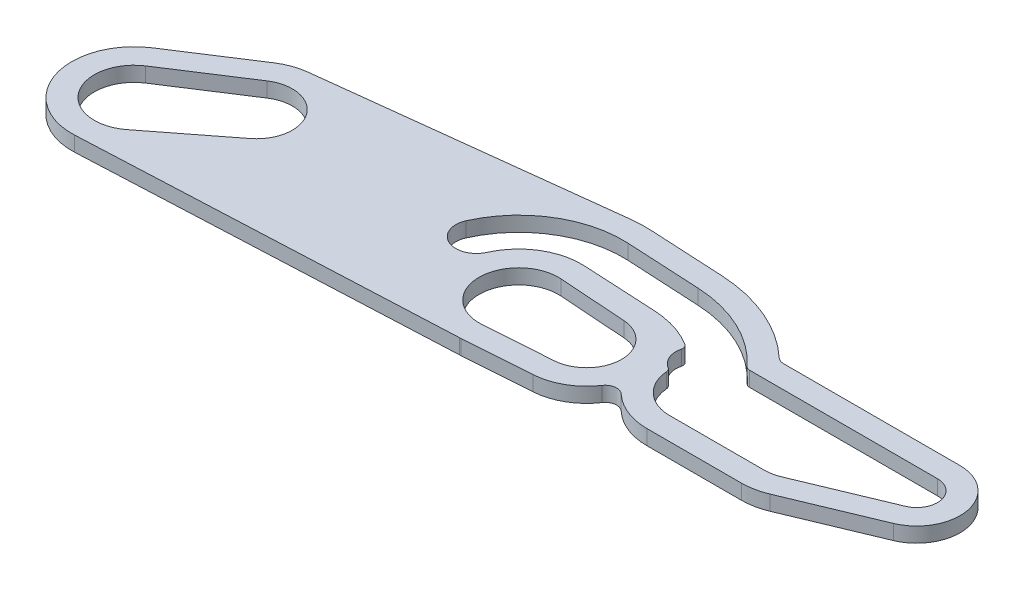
ISO-10303-21;
HEADER;
FILE_DESCRIPTION(('STEP AP214'),'2;1');
FILE_NAME('part.step','',(''),(''),'','','');
FILE_SCHEMA(('AUTOMOTIVE_DESIGN { 1 0 10303 214 1 1 1 1 }'));
ENDSEC;
DATA;
#1=APPLICATION_CONTEXT('core data for automotive mechanical design processes');
#2=APPLICATION_PROTOCOL_DEFINITION('international standard','automotive_design',2000,#1);
#3=PRODUCT_CONTEXT('',#1,'mechanical');
#4=PRODUCT('Part','Part','',(#3));
#5=PRODUCT_RELATED_PRODUCT_CATEGORY('part','',(#4));
#6=PRODUCT_DEFINITION_FORMATION('','',#4);
#7=PRODUCT_DEFINITION_CONTEXT('part definition',#1,'design');
#8=PRODUCT_DEFINITION('design','',#6,#7);
#9=PRODUCT_DEFINITION_SHAPE('','',#8);
#10=(LENGTH_UNIT() NAMED_UNIT(*) SI_UNIT(.MILLI.,.METRE.));
#11=(NAMED_UNIT(*) PLANE_ANGLE_UNIT() SI_UNIT($,.RADIAN.));
#12=(NAMED_UNIT(*) SI_UNIT($,.STERADIAN.) SOLID_ANGLE_UNIT());
#13=UNCERTAINTY_MEASURE_WITH_UNIT(LENGTH_MEASURE(1.E-05),#10,'distance_accuracy_value','');
#14=(GEOMETRIC_REPRESENTATION_CONTEXT(3) GLOBAL_UNCERTAINTY_ASSIGNED_CONTEXT((#13)) GLOBAL_UNIT_ASSIGNED_CONTEXT((#10,
#11,#12)) REPRESENTATION_CONTEXT('',''));
#15=CARTESIAN_POINT('',(0.,0.,0.));
#16=DIRECTION('',(0.,0.,1.));
#17=DIRECTION('',(1.,0.,0.));
#18=AXIS2_PLACEMENT_3D('',#15,#16,#17);
#19=CARTESIAN_POINT('',(32.5292692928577,-51.96,3.67665061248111));
#20=DIRECTION('',(0.,-1.,0.));
#21=DIRECTION('',(0.,0.,-1.));
#22=AXIS2_PLACEMENT_3D('',#19,#20,#21);
#23=CYLINDRICAL_SURFACE('',#22,8.39043126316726);
#24=CARTESIAN_POINT('',(32.5292692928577,-52.75,3.67665061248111));
#25=DIRECTION('',(0.,-1.,0.));
#26=DIRECTION('',(0.,0.,-1.));
#27=AXIS2_PLACEMENT_3D('',#24,#25,#26);
#28=CIRCLE('',#27,8.39043126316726);
#29=CARTESIAN_POINT('',(32.9683905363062,-52.75,-4.70228185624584));
#30=VERTEX_POINT('',#29);
#31=CARTESIAN_POINT('',(38.2500626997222,-52.75,-2.46108997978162));
#32=VERTEX_POINT('',#31);
#33=EDGE_CURVE('E518',#30,#32,#28,.T.);
#34=ORIENTED_EDGE('',*,*,#33,.F.);
#35=DIRECTION('',(0.,-1.,0.));
#36=VECTOR('',#35,1.);
#37=CARTESIAN_POINT('',(32.9683905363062,-51.96,-4.70228185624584));
#38=LINE('',#37,#36);
#39=CARTESIAN_POINT('',(32.9683905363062,-51.96,-4.70228185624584));
#40=VERTEX_POINT('',#39);
#41=EDGE_CURVE('E11',#40,#30,#38,.T.);
#42=ORIENTED_EDGE('',*,*,#41,.F.);
#43=CARTESIAN_POINT('',(32.5292692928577,-51.96,3.67665061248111));
#44=DIRECTION('',(0.,-1.,0.));
#45=DIRECTION('',(0.,0.,-1.));
#46=AXIS2_PLACEMENT_3D('',#43,#44,#45);
#47=CIRCLE('',#46,8.39043126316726);
#48=CARTESIAN_POINT('',(38.2500626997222,-51.96,-2.46108997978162));
#49=VERTEX_POINT('',#48);
#50=EDGE_CURVE('E525',#40,#49,#47,.T.);
#51=ORIENTED_EDGE('',*,*,#50,.T.);
#52=DIRECTION('',(0.,-1.,0.));
#53=VECTOR('',#52,1.);
#54=CARTESIAN_POINT('',(38.2500626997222,-51.96,-2.46108997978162));
#55=LINE('',#54,#53);
#56=EDGE_CURVE('E42',#49,#32,#55,.T.);
#57=ORIENTED_EDGE('',*,*,#56,.T.);
#58=EDGE_LOOP('',(#34,#42,#51,#57));
#59=FACE_BOUND('',#58,.T.);
#60=ADVANCED_FACE('F39',(#59),#23,.T.);
#61=CARTESIAN_POINT('',(29.0515281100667,-51.96,-4.90755591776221));
#62=DIRECTION('',(0.0523359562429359,0.,-0.998629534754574));
#63=DIRECTION('',(-0.998629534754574,0.,-0.0523359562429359));
#64=AXIS2_PLACEMENT_3D('',#61,#62,#63);
#65=PLANE('',#64);
#66=DIRECTION('',(0.998629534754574,0.,0.0523359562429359));
#67=VECTOR('',#66,1.);
#68=CARTESIAN_POINT('',(29.0515281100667,-52.75,-4.90755591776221));
#69=LINE('',#68,#67);
#70=CARTESIAN_POINT('',(29.0515281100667,-52.75,-4.90755591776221));
#71=VERTEX_POINT('',#70);
#72=EDGE_CURVE('E529',#71,#30,#69,.T.);
#73=ORIENTED_EDGE('',*,*,#72,.F.);
#74=DIRECTION('',(0.,-1.,0.));
#75=VECTOR('',#74,1.);
#76=CARTESIAN_POINT('',(29.0515281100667,-51.96,-4.90755591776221));
#77=LINE('',#76,#75);
#78=CARTESIAN_POINT('',(29.0515281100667,-51.96,-4.90755591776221));
#79=VERTEX_POINT('',#78);
#80=EDGE_CURVE('E47',#79,#71,#77,.T.);
#81=ORIENTED_EDGE('',*,*,#80,.F.);
#82=DIRECTION('',(0.998629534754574,0.,0.0523359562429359));
#83=VECTOR('',#82,1.);
#84=CARTESIAN_POINT('',(29.0515281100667,-51.96,-4.90755591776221));
#85=LINE('',#84,#83);
#86=EDGE_CURVE('E580',#79,#40,#85,.T.);
#87=ORIENTED_EDGE('',*,*,#86,.T.);
#88=ORIENTED_EDGE('',*,*,#41,.T.);
#89=EDGE_LOOP('',(#73,#81,#87,#88));
#90=FACE_BOUND('',#89,.T.);
#91=ADVANCED_FACE('F682',(#90),#65,.T.);
#92=CARTESIAN_POINT('',(28.7,-51.96,1.8));
#93=DIRECTION('',(0.,-1.,0.));
#94=DIRECTION('',(0.,0.,-1.));
#95=AXIS2_PLACEMENT_3D('',#92,#93,#94);
#96=CYLINDRICAL_SURFACE('',#95,6.71676100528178);
#97=CARTESIAN_POINT('',(28.7,-52.75,1.8));
#98=DIRECTION('',(0.,-1.,0.));
#99=DIRECTION('',(0.,0.,-1.));
#100=AXIS2_PLACEMENT_3D('',#97,#98,#99);
#101=CIRCLE('',#100,6.71676100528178);
#102=CARTESIAN_POINT('',(27.9175113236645,-52.75,-4.87102614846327));
#103=VERTEX_POINT('',#102);
#104=EDGE_CURVE('E633',#103,#71,#101,.T.);
#105=ORIENTED_EDGE('',*,*,#104,.F.);
#106=DIRECTION('',(0.,-1.,0.));
#107=VECTOR('',#106,1.);
#108=CARTESIAN_POINT('',(27.9175113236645,-51.96,-4.87102614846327));
#109=LINE('',#108,#107);
#110=CARTESIAN_POINT('',(27.9175113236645,-51.96,-4.87102614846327));
#111=VERTEX_POINT('',#110);
#112=EDGE_CURVE('E639',#111,#103,#109,.T.);
#113=ORIENTED_EDGE('',*,*,#112,.F.);
#114=CARTESIAN_POINT('',(28.7,-51.96,1.8));
#115=DIRECTION('',(0.,-1.,0.));
#116=DIRECTION('',(0.,0.,-1.));
#117=AXIS2_PLACEMENT_3D('',#114,#115,#116);
#118=CIRCLE('',#117,6.71676100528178);
#119=EDGE_CURVE('E577',#111,#79,#118,.T.);
#120=ORIENTED_EDGE('',*,*,#119,.T.);
#121=ORIENTED_EDGE('',*,*,#80,.T.);
#122=EDGE_LOOP('',(#105,#113,#120,#121));
#123=FACE_BOUND('',#122,.T.);
#124=ADVANCED_FACE('F746',(#123),#96,.T.);
#125=CARTESIAN_POINT('',(12.638856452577,-51.96,-3.07889190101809));
#126=DIRECTION('',(-0.116497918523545,0.,-0.993190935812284));
#127=DIRECTION('',(-0.993190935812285,0.,0.116497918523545));
#128=AXIS2_PLACEMENT_3D('',#125,#126,#127);
#129=PLANE('',#128);
#130=DIRECTION('',(0.993190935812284,0.,-0.116497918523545));
#131=VECTOR('',#130,1.);
#132=CARTESIAN_POINT('',(12.638856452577,-52.75,-3.07889190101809));
#133=LINE('',#132,#131);
#134=CARTESIAN_POINT('',(12.638856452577,-52.75,-3.07889190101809));
#135=VERTEX_POINT('',#134);
#136=EDGE_CURVE('E630',#135,#103,#133,.T.);
#137=ORIENTED_EDGE('',*,*,#136,.F.);
#138=DIRECTION('',(0.,-1.,0.));
#139=VECTOR('',#138,1.);
#140=CARTESIAN_POINT('',(12.638856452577,-51.96,-3.07889190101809));
#141=LINE('',#140,#139);
#142=CARTESIAN_POINT('',(12.638856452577,-51.96,-3.07889190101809));
#143=VERTEX_POINT('',#142);
#144=EDGE_CURVE('E641',#143,#135,#141,.T.);
#145=ORIENTED_EDGE('',*,*,#144,.F.);
#146=DIRECTION('',(0.993190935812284,0.,-0.116497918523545));
#147=VECTOR('',#146,1.);
#148=CARTESIAN_POINT('',(12.638856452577,-51.96,-3.07889190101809));
#149=LINE('',#148,#147);
#150=EDGE_CURVE('E574',#143,#111,#149,.T.);
#151=ORIENTED_EDGE('',*,*,#150,.T.);
#152=ORIENTED_EDGE('',*,*,#112,.T.);
#153=EDGE_LOOP('',(#137,#145,#151,#152));
#154=FACE_BOUND('',#153,.T.);
#155=ADVANCED_FACE('F744',(#154),#129,.T.);
#156=CARTESIAN_POINT('',(13.,-51.96,0.));
#157=DIRECTION('',(0.,-1.,0.));
#158=DIRECTION('',(0.,0.,-1.));
#159=AXIS2_PLACEMENT_3D('',#156,#157,#158);
#160=CYLINDRICAL_SURFACE('',#159,3.1);
#161=CARTESIAN_POINT('',(13.,-52.75,0.));
#162=DIRECTION('',(0.,-1.,0.));
#163=DIRECTION('',(0.,0.,-1.));
#164=AXIS2_PLACEMENT_3D('',#161,#162,#163);
#165=CIRCLE('',#164,3.1);
#166=CARTESIAN_POINT('',(11.3145327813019,-52.75,-2.60176867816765));
#167=VERTEX_POINT('',#166);
#168=EDGE_CURVE('E627',#167,#135,#165,.T.);
#169=ORIENTED_EDGE('',*,*,#168,.F.);
#170=DIRECTION('',(0.,-1.,0.));
#171=VECTOR('',#170,1.);
#172=CARTESIAN_POINT('',(11.3145327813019,-51.96,-2.60176867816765));
#173=LINE('',#172,#171);
#174=CARTESIAN_POINT('',(11.3145327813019,-51.96,-2.60176867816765));
#175=VERTEX_POINT('',#174);
#176=EDGE_CURVE('E643',#175,#167,#173,.T.);
#177=ORIENTED_EDGE('',*,*,#176,.F.);
#178=CARTESIAN_POINT('',(13.,-51.96,0.));
#179=DIRECTION('',(0.,-1.,0.));
#180=DIRECTION('',(0.,0.,-1.));
#181=AXIS2_PLACEMENT_3D('',#178,#179,#180);
#182=CIRCLE('',#181,3.1);
#183=EDGE_CURVE('E571',#175,#143,#182,.T.);
#184=ORIENTED_EDGE('',*,*,#183,.T.);
#185=ORIENTED_EDGE('',*,*,#144,.T.);
#186=EDGE_LOOP('',(#169,#177,#184,#185));
#187=FACE_BOUND('',#186,.T.);
#188=ADVANCED_FACE('F740',(#187),#160,.T.);
#189=CARTESIAN_POINT('',(7.40579296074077,-51.96,-0.0696247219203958));
#190=DIRECTION('',(-0.543699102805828,0.,-0.839280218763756));
#191=DIRECTION('',(-0.839280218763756,0.,0.543699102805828));
#192=AXIS2_PLACEMENT_3D('',#189,#190,#191);
#193=PLANE('',#192);
#194=DIRECTION('',(0.839280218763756,0.,-0.543699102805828));
#195=VECTOR('',#194,1.);
#196=CARTESIAN_POINT('',(7.40579296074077,-52.75,-0.0696247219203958));
#197=LINE('',#196,#195);
#198=CARTESIAN_POINT('',(7.40579296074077,-52.75,-0.0696247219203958));
#199=VERTEX_POINT('',#198);
#200=EDGE_CURVE('E624',#199,#167,#197,.T.);
#201=ORIENTED_EDGE('',*,*,#200,.F.);
#202=DIRECTION('',(0.,-1.,0.));
#203=VECTOR('',#202,1.);
#204=CARTESIAN_POINT('',(7.40579296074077,-51.96,-0.0696247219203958));
#205=LINE('',#204,#203);
#206=CARTESIAN_POINT('',(7.40579296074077,-51.96,-0.0696247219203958));
#207=VERTEX_POINT('',#206);
#208=EDGE_CURVE('E645',#207,#199,#205,.T.);
#209=ORIENTED_EDGE('',*,*,#208,.F.);
#210=DIRECTION('',(0.839280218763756,0.,-0.543699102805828));
#211=VECTOR('',#210,1.);
#212=CARTESIAN_POINT('',(7.40579296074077,-51.96,-0.0696247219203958));
#213=LINE('',#212,#211);
#214=EDGE_CURVE('E568',#207,#175,#213,.T.);
#215=ORIENTED_EDGE('',*,*,#214,.T.);
#216=ORIENTED_EDGE('',*,*,#176,.T.);
#217=EDGE_LOOP('',(#201,#209,#215,#216));
#218=FACE_BOUND('',#217,.T.);
#219=ADVANCED_FACE('F736',(#218),#193,.T.);
#220=CARTESIAN_POINT('',(9.2,-51.96,2.7));
#221=DIRECTION('',(0.,-1.,0.));
#222=DIRECTION('',(0.,0.,-1.));
#223=AXIS2_PLACEMENT_3D('',#220,#221,#222);
#224=CYLINDRICAL_SURFACE('',#223,3.3);
#225=CARTESIAN_POINT('',(9.2,-52.75,2.7));
#226=DIRECTION('',(0.,-1.,0.));
#227=DIRECTION('',(0.,0.,-1.));
#228=AXIS2_PLACEMENT_3D('',#225,#226,#227);
#229=CIRCLE('',#228,3.3);
#230=CARTESIAN_POINT('',(9.35214572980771,-52.75,5.99649081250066));
#231=VERTEX_POINT('',#230);
#232=EDGE_CURVE('E621',#231,#199,#229,.T.);
#233=ORIENTED_EDGE('',*,*,#232,.F.);
#234=DIRECTION('',(0.,-1.,0.));
#235=VECTOR('',#234,1.);
#236=CARTESIAN_POINT('',(9.35214572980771,-51.96,5.99649081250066));
#237=LINE('',#236,#235);
#238=CARTESIAN_POINT('',(9.35214572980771,-51.96,5.99649081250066));
#239=VERTEX_POINT('',#238);
#240=EDGE_CURVE('E647',#239,#231,#237,.T.);
#241=ORIENTED_EDGE('',*,*,#240,.F.);
#242=CARTESIAN_POINT('',(9.2,-51.96,2.7));
#243=DIRECTION('',(0.,-1.,0.));
#244=DIRECTION('',(0.,0.,-1.));
#245=AXIS2_PLACEMENT_3D('',#242,#243,#244);
#246=CIRCLE('',#245,3.3);
#247=EDGE_CURVE('E565',#239,#207,#246,.T.);
#248=ORIENTED_EDGE('',*,*,#247,.T.);
#249=ORIENTED_EDGE('',*,*,#208,.T.);
#250=EDGE_LOOP('',(#233,#241,#248,#249));
#251=FACE_BOUND('',#250,.T.);
#252=ADVANCED_FACE('F732',(#251),#224,.T.);
#253=CARTESIAN_POINT('',(28.8521457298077,-51.96,5.09649081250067));
#254=DIRECTION('',(0.0461047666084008,0.,0.998936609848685));
#255=DIRECTION('',(0.998936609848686,0.,-0.0461047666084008));
#256=AXIS2_PLACEMENT_3D('',#253,#254,#255);
#257=PLANE('',#256);
#258=DIRECTION('',(-0.998936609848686,0.,0.0461047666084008));
#259=VECTOR('',#258,1.);
#260=CARTESIAN_POINT('',(28.8521457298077,-52.75,5.09649081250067));
#261=LINE('',#260,#259);
#262=CARTESIAN_POINT('',(28.8521457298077,-52.75,5.09649081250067));
#263=VERTEX_POINT('',#262);
#264=EDGE_CURVE('E618',#263,#231,#261,.T.);
#265=ORIENTED_EDGE('',*,*,#264,.F.);
#266=DIRECTION('',(0.,-1.,0.));
#267=VECTOR('',#266,1.);
#268=CARTESIAN_POINT('',(28.8521457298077,-51.96,5.09649081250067));
#269=LINE('',#268,#267);
#270=CARTESIAN_POINT('',(28.8521457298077,-51.96,5.09649081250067));
#271=VERTEX_POINT('',#270);
#272=EDGE_CURVE('E649',#271,#263,#269,.T.);
#273=ORIENTED_EDGE('',*,*,#272,.F.);
#274=DIRECTION('',(-0.998936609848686,0.,0.0461047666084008));
#275=VECTOR('',#274,1.);
#276=CARTESIAN_POINT('',(28.8521457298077,-51.96,5.09649081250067));
#277=LINE('',#276,#275);
#278=EDGE_CURVE('E562',#271,#239,#277,.T.);
#279=ORIENTED_EDGE('',*,*,#278,.T.);
#280=ORIENTED_EDGE('',*,*,#240,.T.);
#281=EDGE_LOOP('',(#265,#273,#279,#280));
#282=FACE_BOUND('',#281,.T.);
#283=ADVANCED_FACE('F728',(#282),#257,.T.);
#284=CARTESIAN_POINT('',(28.7,-51.96,1.8));
#285=DIRECTION('',(0.,-1.,0.));
#286=DIRECTION('',(0.,0.,-1.));
#287=AXIS2_PLACEMENT_3D('',#284,#285,#286);
#288=CYLINDRICAL_SURFACE('',#287,3.3);
#289=CARTESIAN_POINT('',(28.7,-52.75,1.8));
#290=DIRECTION('',(0.,-1.,0.));
#291=DIRECTION('',(0.,0.,-1.));
#292=AXIS2_PLACEMENT_3D('',#289,#290,#291);
#293=CIRCLE('',#292,3.3);
#294=CARTESIAN_POINT('',(28.9291666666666,-52.75,5.09203320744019));
#295=VERTEX_POINT('',#294);
#296=EDGE_CURVE('E615',#295,#263,#293,.T.);
#297=ORIENTED_EDGE('',*,*,#296,.F.);
#298=DIRECTION('',(0.,-1.,0.));
#299=VECTOR('',#298,1.);
#300=CARTESIAN_POINT('',(28.9291666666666,-51.96,5.09203320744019));
#301=LINE('',#300,#299);
#302=CARTESIAN_POINT('',(28.9291666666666,-51.96,5.09203320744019));
#303=VERTEX_POINT('',#302);
#304=EDGE_CURVE('E651',#303,#295,#301,.T.);
#305=ORIENTED_EDGE('',*,*,#304,.F.);
#306=CARTESIAN_POINT('',(28.7,-51.96,1.8));
#307=DIRECTION('',(0.,-1.,0.));
#308=DIRECTION('',(0.,0.,-1.));
#309=AXIS2_PLACEMENT_3D('',#306,#307,#308);
#310=CIRCLE('',#309,3.3);
#311=EDGE_CURVE('E559',#303,#271,#310,.T.);
#312=ORIENTED_EDGE('',*,*,#311,.T.);
#313=ORIENTED_EDGE('',*,*,#272,.T.);
#314=EDGE_LOOP('',(#297,#305,#312,#313));
#315=FACE_BOUND('',#314,.T.);
#316=ADVANCED_FACE('F724',(#315),#288,.T.);
#317=CARTESIAN_POINT('',(32.5118055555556,-51.96,4.84263675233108));
#318=DIRECTION('',(0.0694444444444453,0.,0.997585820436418));
#319=DIRECTION('',(0.997585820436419,0.,-0.0694444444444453));
#320=AXIS2_PLACEMENT_3D('',#317,#318,#319);
#321=PLANE('',#320);
#322=DIRECTION('',(-0.997585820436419,0.,0.0694444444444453));
#323=VECTOR('',#322,1.);
#324=CARTESIAN_POINT('',(32.5118055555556,-52.75,4.84263675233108));
#325=LINE('',#324,#323);
#326=CARTESIAN_POINT('',(32.5118055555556,-52.75,4.84263675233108));
#327=VERTEX_POINT('',#326);
#328=EDGE_CURVE('E612',#327,#295,#325,.T.);
#329=ORIENTED_EDGE('',*,*,#328,.F.);
#330=DIRECTION('',(0.,-1.,0.));
#331=VECTOR('',#330,1.);
#332=CARTESIAN_POINT('',(32.5118055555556,-51.96,4.84263675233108));
#333=LINE('',#332,#331);
#334=CARTESIAN_POINT('',(32.5118055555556,-51.96,4.84263675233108));
#335=VERTEX_POINT('',#334);
#336=EDGE_CURVE('E653',#335,#327,#333,.T.);
#337=ORIENTED_EDGE('',*,*,#336,.F.);
#338=DIRECTION('',(-0.997585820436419,0.,0.0694444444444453));
#339=VECTOR('',#338,1.);
#340=CARTESIAN_POINT('',(32.5118055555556,-51.96,4.84263675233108));
#341=LINE('',#340,#339);
#342=EDGE_CURVE('E556',#335,#303,#341,.T.);
#343=ORIENTED_EDGE('',*,*,#342,.T.);
#344=ORIENTED_EDGE('',*,*,#304,.T.);
#345=EDGE_LOOP('',(#329,#337,#343,#344));
#346=FACE_BOUND('',#345,.T.);
#347=ADVANCED_FACE('F720',(#346),#321,.T.);
#348=CARTESIAN_POINT('',(32.3,-51.96,1.8));
#349=DIRECTION('',(0.,-1.,0.));
#350=DIRECTION('',(0.,0.,-1.));
#351=AXIS2_PLACEMENT_3D('',#348,#349,#350);
#352=CYLINDRICAL_SURFACE('',#351,3.05);
#353=CARTESIAN_POINT('',(32.3,-52.75,1.8));
#354=DIRECTION('',(0.,-1.,0.));
#355=DIRECTION('',(0.,0.,-1.));
#356=AXIS2_PLACEMENT_3D('',#353,#354,#355);
#357=CIRCLE('',#356,3.05);
#358=CARTESIAN_POINT('',(34.8292885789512,-52.75,3.50446451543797));
#359=VERTEX_POINT('',#358);
#360=EDGE_CURVE('E609',#359,#327,#357,.T.);
#361=ORIENTED_EDGE('',*,*,#360,.F.);
#362=DIRECTION('',(0.,-1.,0.));
#363=VECTOR('',#362,1.);
#364=CARTESIAN_POINT('',(34.8292885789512,-51.96,3.50446451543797));
#365=LINE('',#364,#363);
#366=CARTESIAN_POINT('',(34.8292885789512,-51.96,3.50446451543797));
#367=VERTEX_POINT('',#366);
#368=EDGE_CURVE('E655',#367,#359,#365,.T.);
#369=ORIENTED_EDGE('',*,*,#368,.F.);
#370=CARTESIAN_POINT('',(32.3,-51.96,1.8));
#371=DIRECTION('',(0.,-1.,0.));
#372=DIRECTION('',(0.,0.,-1.));
#373=AXIS2_PLACEMENT_3D('',#370,#371,#372);
#374=CIRCLE('',#373,3.05);
#375=EDGE_CURVE('E553',#367,#335,#374,.T.);
#376=ORIENTED_EDGE('',*,*,#375,.T.);
#377=ORIENTED_EDGE('',*,*,#336,.T.);
#378=EDGE_LOOP('',(#361,#369,#376,#377));
#379=FACE_BOUND('',#378,.T.);
#380=ADVANCED_FACE('F716',(#379),#352,.T.);
#381=CARTESIAN_POINT('',(35.3268535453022,-51.96,3.83976901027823));
#382=DIRECTION('',(0.,-1.,0.));
#383=DIRECTION('',(0.,0.,-1.));
#384=AXIS2_PLACEMENT_3D('',#381,#382,#383);
#385=CYLINDRICAL_SURFACE('',#384,0.599999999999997);
#386=CARTESIAN_POINT('',(35.3268535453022,-52.75,3.83976901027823));
#387=DIRECTION('',(0.,1.,0.));
#388=DIRECTION('',(0.,0.,-1.));
#389=AXIS2_PLACEMENT_3D('',#386,#387,#388);
#390=CIRCLE('',#389,0.599999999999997);
#391=CARTESIAN_POINT('',(35.7381068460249,-52.75,3.40288147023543));
#392=VERTEX_POINT('',#391);
#393=EDGE_CURVE('E606',#392,#359,#390,.T.);
#394=ORIENTED_EDGE('',*,*,#393,.F.);
#395=DIRECTION('',(0.,-1.,0.));
#396=VECTOR('',#395,1.);
#397=CARTESIAN_POINT('',(35.7381068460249,-51.96,3.40288147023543));
#398=LINE('',#397,#396);
#399=CARTESIAN_POINT('',(35.7381068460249,-51.96,3.40288147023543));
#400=VERTEX_POINT('',#399);
#401=EDGE_CURVE('E657',#400,#392,#398,.T.);
#402=ORIENTED_EDGE('',*,*,#401,.F.);
#403=CARTESIAN_POINT('',(35.3268535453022,-51.96,3.83976901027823));
#404=DIRECTION('',(0.,1.,0.));
#405=DIRECTION('',(0.,0.,-1.));
#406=AXIS2_PLACEMENT_3D('',#403,#404,#405);
#407=CIRCLE('',#406,0.599999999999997);
#408=EDGE_CURVE('E550',#400,#367,#407,.T.);
#409=ORIENTED_EDGE('',*,*,#408,.T.);
#410=ORIENTED_EDGE('',*,*,#368,.T.);
#411=EDGE_LOOP('',(#394,#402,#409,#410));
#412=FACE_BOUND('',#411,.T.);
#413=ADVANCED_FACE('F712',(#412),#385,.F.);
#414=CARTESIAN_POINT('',(38.,-51.96,1.));
#415=DIRECTION('',(0.,-1.,0.));
#416=DIRECTION('',(0.,0.,-1.));
#417=AXIS2_PLACEMENT_3D('',#414,#415,#416);
#418=CYLINDRICAL_SURFACE('',#417,3.29999999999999);
#419=CARTESIAN_POINT('',(38.,-52.75,1.));
#420=DIRECTION('',(0.,-1.,0.));
#421=DIRECTION('',(0.,0.,-1.));
#422=AXIS2_PLACEMENT_3D('',#419,#420,#421);
#423=CIRCLE('',#422,3.29999999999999);
#424=CARTESIAN_POINT('',(38.,-52.75,4.29999999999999));
#425=VERTEX_POINT('',#424);
#426=EDGE_CURVE('E603',#425,#392,#423,.T.);
#427=ORIENTED_EDGE('',*,*,#426,.F.);
#428=DIRECTION('',(0.,-1.,0.));
#429=VECTOR('',#428,1.);
#430=CARTESIAN_POINT('',(38.,-51.96,4.29999999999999));
#431=LINE('',#430,#429);
#432=CARTESIAN_POINT('',(38.,-51.96,4.29999999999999));
#433=VERTEX_POINT('',#432);
#434=EDGE_CURVE('E659',#433,#425,#431,.T.);
#435=ORIENTED_EDGE('',*,*,#434,.F.);
#436=CARTESIAN_POINT('',(38.,-51.96,1.));
#437=DIRECTION('',(0.,-1.,0.));
#438=DIRECTION('',(0.,0.,-1.));
#439=AXIS2_PLACEMENT_3D('',#436,#437,#438);
#440=CIRCLE('',#439,3.29999999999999);
#441=EDGE_CURVE('E547',#433,#400,#440,.T.);
#442=ORIENTED_EDGE('',*,*,#441,.T.);
#443=ORIENTED_EDGE('',*,*,#401,.T.);
#444=EDGE_LOOP('',(#427,#435,#442,#443));
#445=FACE_BOUND('',#444,.T.);
#446=ADVANCED_FACE('F708',(#445),#418,.T.);
#447=CARTESIAN_POINT('',(43.,-51.96,4.3));
#448=DIRECTION('',(0.,0.,1.));
#449=DIRECTION('',(1.,0.,0.));
#450=AXIS2_PLACEMENT_3D('',#447,#448,#449);
#451=PLANE('',#450);
#452=DIRECTION('',(-1.,0.,0.));
#453=VECTOR('',#452,1.);
#454=CARTESIAN_POINT('',(43.,-52.75,4.3));
#455=LINE('',#454,#453);
#456=CARTESIAN_POINT('',(43.,-52.75,4.3));
#457=VERTEX_POINT('',#456);
#458=EDGE_CURVE('E600',#457,#425,#455,.T.);
#459=ORIENTED_EDGE('',*,*,#458,.F.);
#460=DIRECTION('',(0.,-1.,0.));
#461=VECTOR('',#460,1.);
#462=CARTESIAN_POINT('',(43.,-51.96,4.3));
#463=LINE('',#462,#461);
#464=CARTESIAN_POINT('',(43.,-51.96,4.3));
#465=VERTEX_POINT('',#464);
#466=EDGE_CURVE('E661',#465,#457,#463,.T.);
#467=ORIENTED_EDGE('',*,*,#466,.F.);
#468=DIRECTION('',(-1.,0.,0.));
#469=VECTOR('',#468,1.);
#470=CARTESIAN_POINT('',(43.,-51.96,4.3));
#471=LINE('',#470,#469);
#472=EDGE_CURVE('E544',#465,#433,#471,.T.);
#473=ORIENTED_EDGE('',*,*,#472,.T.);
#474=ORIENTED_EDGE('',*,*,#434,.T.);
#475=EDGE_LOOP('',(#459,#467,#473,#474));
#476=FACE_BOUND('',#475,.T.);
#477=ADVANCED_FACE('F704',(#476),#451,.T.);
#478=CARTESIAN_POINT('',(43.,-51.96,1.));
#479=DIRECTION('',(0.,-1.,0.));
#480=DIRECTION('',(0.,0.,-1.));
#481=AXIS2_PLACEMENT_3D('',#478,#479,#480);
#482=CYLINDRICAL_SURFACE('',#481,3.3);
#483=CARTESIAN_POINT('',(43.,-52.75,1.));
#484=DIRECTION('',(0.,-1.,0.));
#485=DIRECTION('',(0.,0.,-1.));
#486=AXIS2_PLACEMENT_3D('',#483,#484,#485);
#487=CIRCLE('',#486,3.3);
#488=CARTESIAN_POINT('',(44.2692307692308,-52.75,4.04615384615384));
#489=VERTEX_POINT('',#488);
#490=EDGE_CURVE('E597',#489,#457,#487,.T.);
#491=ORIENTED_EDGE('',*,*,#490,.F.);
#492=DIRECTION('',(0.,-1.,0.));
#493=VECTOR('',#492,1.);
#494=CARTESIAN_POINT('',(44.2692307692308,-51.96,4.04615384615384));
#495=LINE('',#494,#493);
#496=CARTESIAN_POINT('',(44.2692307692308,-51.96,4.04615384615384));
#497=VERTEX_POINT('',#496);
#498=EDGE_CURVE('E663',#497,#489,#495,.T.);
#499=ORIENTED_EDGE('',*,*,#498,.F.);
#500=CARTESIAN_POINT('',(43.,-51.96,1.));
#501=DIRECTION('',(0.,-1.,0.));
#502=DIRECTION('',(0.,0.,-1.));
#503=AXIS2_PLACEMENT_3D('',#500,#501,#502);
#504=CIRCLE('',#503,3.3);
#505=EDGE_CURVE('E541',#497,#465,#504,.T.);
#506=ORIENTED_EDGE('',*,*,#505,.T.);
#507=ORIENTED_EDGE('',*,*,#466,.T.);
#508=EDGE_LOOP('',(#491,#499,#506,#507));
#509=FACE_BOUND('',#508,.T.);
#510=ADVANCED_FACE('F700',(#509),#482,.T.);
#511=CARTESIAN_POINT('',(48.8846153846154,-51.96,2.12307692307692));
#512=DIRECTION('',(0.384615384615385,0.,0.923076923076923));
#513=DIRECTION('',(0.923076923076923,0.,-0.384615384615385));
#514=AXIS2_PLACEMENT_3D('',#511,#512,#513);
#515=PLANE('',#514);
#516=DIRECTION('',(-0.923076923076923,0.,0.384615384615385));
#517=VECTOR('',#516,1.);
#518=CARTESIAN_POINT('',(48.8846153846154,-52.75,2.12307692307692));
#519=LINE('',#518,#517);
#520=CARTESIAN_POINT('',(48.8846153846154,-52.75,2.12307692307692));
#521=VERTEX_POINT('',#520);
#522=EDGE_CURVE('E594',#521,#489,#519,.T.);
#523=ORIENTED_EDGE('',*,*,#522,.F.);
#524=DIRECTION('',(0.,-1.,0.));
#525=VECTOR('',#524,1.);
#526=CARTESIAN_POINT('',(48.8846153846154,-51.96,2.12307692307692));
#527=LINE('',#526,#525);
#528=CARTESIAN_POINT('',(48.8846153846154,-51.96,2.12307692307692));
#529=VERTEX_POINT('',#528);
#530=EDGE_CURVE('E665',#529,#521,#527,.T.);
#531=ORIENTED_EDGE('',*,*,#530,.F.);
#532=DIRECTION('',(-0.923076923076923,0.,0.384615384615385));
#533=VECTOR('',#532,1.);
#534=CARTESIAN_POINT('',(48.8846153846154,-51.96,2.12307692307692));
#535=LINE('',#534,#533);
#536=EDGE_CURVE('E538',#529,#497,#535,.T.);
#537=ORIENTED_EDGE('',*,*,#536,.T.);
#538=ORIENTED_EDGE('',*,*,#498,.T.);
#539=EDGE_LOOP('',(#523,#531,#537,#538));
#540=FACE_BOUND('',#539,.T.);
#541=ADVANCED_FACE('F696',(#540),#515,.T.);
#542=CARTESIAN_POINT('',(48.,-51.96,0.));
#543=DIRECTION('',(0.,-1.,0.));
#544=DIRECTION('',(0.,0.,-1.));
#545=AXIS2_PLACEMENT_3D('',#542,#543,#544);
#546=CYLINDRICAL_SURFACE('',#545,2.3);
#547=CARTESIAN_POINT('',(48.,-52.75,0.));
#548=DIRECTION('',(0.,-1.,0.));
#549=DIRECTION('',(0.,0.,-1.));
#550=AXIS2_PLACEMENT_3D('',#547,#548,#549);
#551=CIRCLE('',#550,2.3);
#552=CARTESIAN_POINT('',(48.,-52.75,-2.3));
#553=VERTEX_POINT('',#552);
#554=EDGE_CURVE('E591',#553,#521,#551,.T.);
#555=ORIENTED_EDGE('',*,*,#554,.F.);
#556=DIRECTION('',(0.,-1.,0.));
#557=VECTOR('',#556,1.);
#558=CARTESIAN_POINT('',(48.,-51.96,-2.3));
#559=LINE('',#558,#557);
#560=CARTESIAN_POINT('',(48.,-51.96,-2.3));
#561=VERTEX_POINT('',#560);
#562=EDGE_CURVE('E667',#561,#553,#559,.T.);
#563=ORIENTED_EDGE('',*,*,#562,.F.);
#564=CARTESIAN_POINT('',(48.,-51.96,0.));
#565=DIRECTION('',(0.,-1.,0.));
#566=DIRECTION('',(0.,0.,-1.));
#567=AXIS2_PLACEMENT_3D('',#564,#565,#566);
#568=CIRCLE('',#567,2.3);
#569=EDGE_CURVE('E535',#561,#529,#568,.T.);
#570=ORIENTED_EDGE('',*,*,#569,.T.);
#571=ORIENTED_EDGE('',*,*,#530,.T.);
#572=EDGE_LOOP('',(#555,#563,#570,#571));
#573=FACE_BOUND('',#572,.T.);
#574=ADVANCED_FACE('F694',(#573),#546,.T.);
#575=CARTESIAN_POINT('',(38.6591568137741,-51.96,-2.3));
#576=DIRECTION('',(0.,0.,-1.));
#577=DIRECTION('',(-1.,0.,0.));
#578=AXIS2_PLACEMENT_3D('',#575,#576,#577);
#579=PLANE('',#578);
#580=DIRECTION('',(1.,0.,0.));
#581=VECTOR('',#580,1.);
#582=CARTESIAN_POINT('',(38.6591568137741,-52.75,-2.3));
#583=LINE('',#582,#581);
#584=CARTESIAN_POINT('',(38.6591568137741,-52.75,-2.3));
#585=VERTEX_POINT('',#584);
#586=EDGE_CURVE('E588',#585,#553,#583,.T.);
#587=ORIENTED_EDGE('',*,*,#586,.F.);
#588=DIRECTION('',(0.,-1.,0.));
#589=VECTOR('',#588,1.);
#590=CARTESIAN_POINT('',(38.6591568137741,-51.96,-2.3));
#591=LINE('',#590,#589);
#592=CARTESIAN_POINT('',(38.6591568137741,-51.96,-2.3));
#593=VERTEX_POINT('',#592);
#594=EDGE_CURVE('E668',#593,#585,#591,.T.);
#595=ORIENTED_EDGE('',*,*,#594,.F.);
#596=DIRECTION('',(1.,0.,0.));
#597=VECTOR('',#596,1.);
#598=CARTESIAN_POINT('',(38.6591568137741,-51.96,-2.3));
#599=LINE('',#598,#597);
#600=EDGE_CURVE('E532',#593,#561,#599,.T.);
#601=ORIENTED_EDGE('',*,*,#600,.T.);
#602=ORIENTED_EDGE('',*,*,#562,.T.);
#603=EDGE_LOOP('',(#587,#595,#601,#602));
#604=FACE_BOUND('',#603,.T.);
#605=ADVANCED_FACE('F690',(#604),#579,.T.);
#606=CARTESIAN_POINT('',(38.6591568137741,-51.96,-2.89999999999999));
#607=DIRECTION('',(0.,-1.,0.));
#608=DIRECTION('',(0.,0.,-1.));
#609=AXIS2_PLACEMENT_3D('',#606,#607,#608);
#610=CYLINDRICAL_SURFACE('',#609,0.599999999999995);
#611=CARTESIAN_POINT('',(38.6591568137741,-52.75,-2.89999999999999));
#612=DIRECTION('',(0.,1.,0.));
#613=DIRECTION('',(0.,0.,-1.));
#614=AXIS2_PLACEMENT_3D('',#611,#612,#613);
#615=CIRCLE('',#614,0.599999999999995);
#616=EDGE_CURVE('E585',#32,#585,#615,.T.);
#617=ORIENTED_EDGE('',*,*,#616,.F.);
#618=ORIENTED_EDGE('',*,*,#56,.F.);
#619=CARTESIAN_POINT('',(38.6591568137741,-51.96,-2.89999999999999));
#620=DIRECTION('',(0.,1.,0.));
#621=DIRECTION('',(0.,0.,-1.));
#622=AXIS2_PLACEMENT_3D('',#619,#620,#621);
#623=CIRCLE('',#622,0.599999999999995);
#624=EDGE_CURVE('E528',#49,#593,#623,.T.);
#625=ORIENTED_EDGE('',*,*,#624,.T.);
#626=ORIENTED_EDGE('',*,*,#594,.T.);
#627=EDGE_LOOP('',(#617,#618,#625,#626));
#628=FACE_BOUND('',#627,.T.);
#629=ADVANCED_FACE('F676',(#628),#610,.F.);
#630=CARTESIAN_POINT('',(32.5292692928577,-51.96,3.67665061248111));
#631=DIRECTION('',(0.,-1.,0.));
#632=DIRECTION('',(0.,0.,-1.));
#633=AXIS2_PLACEMENT_3D('',#630,#631,#632);
#634=PLANE('',#633);
#635=CARTESIAN_POINT('',(38.,-51.96,1.));
#636=DIRECTION('',(0.,-1.,0.));
#637=DIRECTION('',(0.,0.,-1.));
#638=AXIS2_PLACEMENT_3D('',#635,#636,#637);
#639=CIRCLE('',#638,2.10000000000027);
#640=CARTESIAN_POINT('',(38.,-51.96,3.09999999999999));
#641=VERTEX_POINT('',#640);
#642=CARTESIAN_POINT('',(35.9071254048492,-51.96,1.17284654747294));
#643=VERTEX_POINT('',#642);
#644=EDGE_CURVE('E328',#641,#643,#639,.T.);
#645=ORIENTED_EDGE('',*,*,#644,.T.);
#646=CARTESIAN_POINT('',(35.6081433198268,-51.96,1.19753891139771));
#647=DIRECTION('',(0.,1.,0.));
#648=DIRECTION('',(0.,0.,-1.));
#649=AXIS2_PLACEMENT_3D('',#646,#647,#648);
#650=CIRCLE('',#649,0.300000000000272);
#651=CARTESIAN_POINT('',(35.7635411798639,-51.96,0.940923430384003));
#652=VERTEX_POINT('',#651);
#653=EDGE_CURVE('E322',#643,#652,#650,.T.);
#654=ORIENTED_EDGE('',*,*,#653,.T.);
#655=CARTESIAN_POINT('',(36.3333333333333,-51.96,0.));
#656=DIRECTION('',(0.,-1.,0.));
#657=DIRECTION('',(0.,0.,-1.));
#658=AXIS2_PLACEMENT_3D('',#655,#656,#657);
#659=CIRCLE('',#658,1.10000000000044);
#660=CARTESIAN_POINT('',(35.2638360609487,-51.96,-0.257246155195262));
#661=VERTEX_POINT('',#660);
#662=EDGE_CURVE('E331',#652,#661,#659,.T.);
#663=ORIENTED_EDGE('',*,*,#662,.T.);
#664=CARTESIAN_POINT('',(34.9721549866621,-51.96,-0.327404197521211));
#665=DIRECTION('',(0.,1.,0.));
#666=DIRECTION('',(0.,0.,-1.));
#667=AXIS2_PLACEMENT_3D('',#664,#665,#666);
#668=CIRCLE('',#667,0.299999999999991);
#669=CARTESIAN_POINT('',(35.1284019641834,-51.96,-0.583503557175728));
#670=VERTEX_POINT('',#669);
#671=EDGE_CURVE('E55',#661,#670,#668,.T.);
#672=ORIENTED_EDGE('',*,*,#671,.T.);
#673=CARTESIAN_POINT('',(32.5292692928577,-51.96,3.67665061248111));
#674=DIRECTION('',(0.,1.,0.));
#675=DIRECTION('',(0.,0.,-1.));
#676=AXIS2_PLACEMENT_3D('',#673,#674,#675);
#677=CIRCLE('',#676,4.99043126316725);
#678=CARTESIAN_POINT('',(32.7904482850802,-51.96,-1.30694143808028));
#679=VERTEX_POINT('',#678);
#680=EDGE_CURVE('E346',#670,#679,#677,.T.);
#681=ORIENTED_EDGE('',*,*,#680,.T.);
#682=DIRECTION('',(-0.998629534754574,0.,-0.0523359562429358));
#683=VECTOR('',#682,1.);
#684=CARTESIAN_POINT('',(32.7904482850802,-51.96,-1.30694143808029));
#685=LINE('',#684,#683);
#686=CARTESIAN_POINT('',(28.8735858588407,-51.96,-1.51221549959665));
#687=VERTEX_POINT('',#686);
#688=EDGE_CURVE('E349',#679,#687,#685,.T.);
#689=ORIENTED_EDGE('',*,*,#688,.T.);
#690=CARTESIAN_POINT('',(28.7,-51.96,1.8));
#691=DIRECTION('',(0.,1.,0.));
#692=DIRECTION('',(0.,0.,-1.));
#693=AXIS2_PLACEMENT_3D('',#690,#691,#692);
#694=CIRCLE('',#693,3.31676100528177);
#695=CARTESIAN_POINT('',(25.6711735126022,-51.96,0.448292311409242));
#696=VERTEX_POINT('',#695);
#697=EDGE_CURVE('E352',#687,#696,#694,.T.);
#698=ORIENTED_EDGE('',*,*,#697,.T.);
#699=CARTESIAN_POINT('',(24.6666666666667,-51.96,0.));
#700=DIRECTION('',(0.,-1.,0.));
#701=DIRECTION('',(0.,0.,-1.));
#702=AXIS2_PLACEMENT_3D('',#699,#700,#701);
#703=CIRCLE('',#702,1.1);
#704=CARTESIAN_POINT('',(23.6621598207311,-51.96,-0.448292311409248));
#705=VERTEX_POINT('',#704);
#706=EDGE_CURVE('E355',#696,#705,#703,.T.);
#707=ORIENTED_EDGE('',*,*,#706,.T.);
#708=CARTESIAN_POINT('',(28.7,-51.96,1.8));
#709=DIRECTION('',(0.,-1.,0.));
#710=DIRECTION('',(0.,0.,-1.));
#711=AXIS2_PLACEMENT_3D('',#708,#709,#710);
#712=CIRCLE('',#711,5.51676100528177);
#713=CARTESIAN_POINT('',(28.9887249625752,-51.96,-3.70920047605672));
#714=VERTEX_POINT('',#713);
#715=EDGE_CURVE('E358',#705,#714,#712,.T.);
#716=ORIENTED_EDGE('',*,*,#715,.T.);
#717=DIRECTION('',(0.998629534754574,0.,0.0523359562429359));
#718=VECTOR('',#717,1.);
#719=CARTESIAN_POINT('',(28.9887249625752,-51.96,-3.70920047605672));
#720=LINE('',#719,#718);
#721=CARTESIAN_POINT('',(32.9055873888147,-51.96,-3.50392641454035));
#722=VERTEX_POINT('',#721);
#723=EDGE_CURVE('E361',#714,#722,#720,.T.);
#724=ORIENTED_EDGE('',*,*,#723,.T.);
#725=CARTESIAN_POINT('',(32.5292692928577,-51.96,3.67665061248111));
#726=DIRECTION('',(0.,-1.,0.));
#727=DIRECTION('',(0.,0.,-1.));
#728=AXIS2_PLACEMENT_3D('',#725,#726,#727);
#729=CIRCLE('',#728,7.19043126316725);
#730=CARTESIAN_POINT('',(37.8163292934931,-51.96,-1.19667456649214));
#731=VERTEX_POINT('',#730);
#732=EDGE_CURVE('E364',#722,#731,#729,.T.);
#733=ORIENTED_EDGE('',*,*,#732,.T.);
#734=CARTESIAN_POINT('',(38.0369166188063,-51.96,-1.4));
#735=DIRECTION('',(0.,1.,0.));
#736=DIRECTION('',(0.,0.,-1.));
#737=AXIS2_PLACEMENT_3D('',#734,#735,#736);
#738=CIRCLE('',#737,0.300000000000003);
#739=CARTESIAN_POINT('',(38.0369166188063,-51.96,-1.1));
#740=VERTEX_POINT('',#739);
#741=EDGE_CURVE('E367',#731,#740,#738,.T.);
#742=ORIENTED_EDGE('',*,*,#741,.T.);
#743=DIRECTION('',(1.,0.,0.));
#744=VECTOR('',#743,1.);
#745=CARTESIAN_POINT('',(38.0369166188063,-51.96,-1.1));
#746=LINE('',#745,#744);
#747=CARTESIAN_POINT('',(48.,-51.96,-1.1));
#748=VERTEX_POINT('',#747);
#749=EDGE_CURVE('E370',#740,#748,#746,.T.);
#750=ORIENTED_EDGE('',*,*,#749,.T.);
#751=CARTESIAN_POINT('',(48.,-51.96,0.));
#752=DIRECTION('',(0.,-1.,0.));
#753=DIRECTION('',(0.,0.,-1.));
#754=AXIS2_PLACEMENT_3D('',#751,#752,#753);
#755=CIRCLE('',#754,1.1);
#756=CARTESIAN_POINT('',(48.4230769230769,-51.96,1.01538461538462));
#757=VERTEX_POINT('',#756);
#758=EDGE_CURVE('E373',#748,#757,#755,.T.);
#759=ORIENTED_EDGE('',*,*,#758,.T.);
#760=DIRECTION('',(-0.923076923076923,0.,0.384615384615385));
#761=VECTOR('',#760,1.);
#762=CARTESIAN_POINT('',(48.4230769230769,-51.96,1.01538461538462));
#763=LINE('',#762,#761);
#764=CARTESIAN_POINT('',(43.8076923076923,-51.96,2.93846153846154));
#765=VERTEX_POINT('',#764);
#766=EDGE_CURVE('E376',#757,#765,#763,.T.);
#767=ORIENTED_EDGE('',*,*,#766,.T.);
#768=CARTESIAN_POINT('',(43.,-51.96,1.));
#769=DIRECTION('',(0.,-1.,0.));
#770=DIRECTION('',(0.,0.,-1.));
#771=AXIS2_PLACEMENT_3D('',#768,#769,#770);
#772=CIRCLE('',#771,2.1);
#773=CARTESIAN_POINT('',(43.,-51.96,3.1));
#774=VERTEX_POINT('',#773);
#775=EDGE_CURVE('E379',#765,#774,#772,.T.);
#776=ORIENTED_EDGE('',*,*,#775,.T.);
#777=DIRECTION('',(-1.,0.,0.));
#778=VECTOR('',#777,1.);
#779=CARTESIAN_POINT('',(43.,-51.96,3.1));
#780=LINE('',#779,#778);
#781=EDGE_CURVE('E382',#774,#641,#780,.T.);
#782=ORIENTED_EDGE('',*,*,#781,.T.);
#783=EDGE_LOOP('',(#645,#654,#663,#672,#681,#689,#698,#707,#716,#724,#733,#742,#750,#759,#767,
#776,#782));
#784=FACE_BOUND('',#783,.T.);
#785=DIRECTION('',(0.839280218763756,0.,-0.543699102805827));
#786=VECTOR('',#785,1.);
#787=CARTESIAN_POINT('',(8.05823188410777,-51.96,0.937511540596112));
#788=LINE('',#787,#786);
#789=CARTESIAN_POINT('',(8.05823188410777,-51.96,0.937511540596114));
#790=VERTEX_POINT('',#789);
#791=CARTESIAN_POINT('',(11.9669717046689,-51.96,-1.59463241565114));
#792=VERTEX_POINT('',#791);
#793=EDGE_CURVE('E471',#790,#792,#788,.T.);
#794=ORIENTED_EDGE('',*,*,#793,.T.);
#795=CARTESIAN_POINT('',(13.,-51.96,0.));
#796=DIRECTION('',(0.,-1.,0.));
#797=DIRECTION('',(0.,0.,-1.));
#798=AXIS2_PLACEMENT_3D('',#795,#796,#797);
#799=CIRCLE('',#798,1.9);
#800=CARTESIAN_POINT('',(14.1659321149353,-51.96,1.50020075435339));
#801=VERTEX_POINT('',#800);
#802=EDGE_CURVE('E461',#792,#801,#799,.T.);
#803=ORIENTED_EDGE('',*,*,#802,.T.);
#804=DIRECTION('',(-0.789579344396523,0.,0.613648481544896));
#805=VECTOR('',#804,1.);
#806=CARTESIAN_POINT('',(14.1659321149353,-51.96,1.50020075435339));
#807=LINE('',#806,#805);
#808=CARTESIAN_POINT('',(10.4886618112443,-51.96,4.35811662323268));
#809=VERTEX_POINT('',#808);
#810=EDGE_CURVE('E464',#801,#809,#807,.T.);
#811=ORIENTED_EDGE('',*,*,#810,.T.);
#812=CARTESIAN_POINT('',(9.2,-51.96,2.7));
#813=DIRECTION('',(0.,-1.,0.));
#814=DIRECTION('',(0.,0.,-1.));
#815=AXIS2_PLACEMENT_3D('',#812,#813,#814);
#816=CIRCLE('',#815,2.1);
#817=EDGE_CURVE('E468',#809,#790,#816,.T.);
#818=ORIENTED_EDGE('',*,*,#817,.T.);
#819=EDGE_LOOP('',(#794,#803,#811,#818));
#820=FACE_BOUND('',#819,.T.);
#821=DIRECTION('',(-0.997585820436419,0.,0.0694444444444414));
#822=VECTOR('',#821,1.);
#823=CARTESIAN_POINT('',(32.4284722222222,-51.96,3.64553376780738));
#824=LINE('',#823,#822);
#825=CARTESIAN_POINT('',(32.4284722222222,-51.96,3.64553376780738));
#826=VERTEX_POINT('',#825);
#827=CARTESIAN_POINT('',(28.8458333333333,-51.96,3.89493022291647));
#828=VERTEX_POINT('',#827);
#829=EDGE_CURVE('E503',#826,#828,#824,.T.);
#830=ORIENTED_EDGE('',*,*,#829,.T.);
#831=CARTESIAN_POINT('',(28.7,-51.96,1.8));
#832=DIRECTION('',(0.,-1.,0.));
#833=DIRECTION('',(0.,0.,-1.));
#834=AXIS2_PLACEMENT_3D('',#831,#832,#833);
#835=CIRCLE('',#834,2.1);
#836=CARTESIAN_POINT('',(28.8458333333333,-51.96,-0.294930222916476));
#837=VERTEX_POINT('',#836);
#838=EDGE_CURVE('E493',#828,#837,#835,.T.);
#839=ORIENTED_EDGE('',*,*,#838,.T.);
#840=DIRECTION('',(0.997585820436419,0.,0.0694444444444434));
#841=VECTOR('',#840,1.);
#842=CARTESIAN_POINT('',(28.8458333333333,-51.96,-0.294930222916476));
#843=LINE('',#842,#841);
#844=CARTESIAN_POINT('',(32.4284722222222,-51.96,-0.0455337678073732));
#845=VERTEX_POINT('',#844);
#846=EDGE_CURVE('E496',#837,#845,#843,.T.);
#847=ORIENTED_EDGE('',*,*,#846,.T.);
#848=CARTESIAN_POINT('',(32.3,-51.96,1.8));
#849=DIRECTION('',(0.,-1.,0.));
#850=DIRECTION('',(0.,0.,-1.));
#851=AXIS2_PLACEMENT_3D('',#848,#849,#850);
#852=CIRCLE('',#851,1.85);
#853=EDGE_CURVE('E500',#845,#826,#852,.T.);
#854=ORIENTED_EDGE('',*,*,#853,.T.);
#855=EDGE_LOOP('',(#830,#839,#847,#854));
#856=FACE_BOUND('',#855,.T.);
#857=ORIENTED_EDGE('',*,*,#50,.F.);
#858=ORIENTED_EDGE('',*,*,#86,.F.);
#859=ORIENTED_EDGE('',*,*,#119,.F.);
#860=ORIENTED_EDGE('',*,*,#150,.F.);
#861=ORIENTED_EDGE('',*,*,#183,.F.);
#862=ORIENTED_EDGE('',*,*,#214,.F.);
#863=ORIENTED_EDGE('',*,*,#247,.F.);
#864=ORIENTED_EDGE('',*,*,#278,.F.);
#865=ORIENTED_EDGE('',*,*,#311,.F.);
#866=ORIENTED_EDGE('',*,*,#342,.F.);
#867=ORIENTED_EDGE('',*,*,#375,.F.);
#868=ORIENTED_EDGE('',*,*,#408,.F.);
#869=ORIENTED_EDGE('',*,*,#441,.F.);
#870=ORIENTED_EDGE('',*,*,#472,.F.);
#871=ORIENTED_EDGE('',*,*,#505,.F.);
#872=ORIENTED_EDGE('',*,*,#536,.F.);
#873=ORIENTED_EDGE('',*,*,#569,.F.);
#874=ORIENTED_EDGE('',*,*,#600,.F.);
#875=ORIENTED_EDGE('',*,*,#624,.F.);
#876=EDGE_LOOP('',(#857,#858,#859,#860,#861,#862,#863,#864,#865,#866,#867,#868,#869,#870,#871,
#872,#873,#874,#875));
#877=FACE_BOUND('',#876,.T.);
#878=ADVANCED_FACE('F335',(#784,#820,#856,#877),#634,.F.);
#879=CARTESIAN_POINT('',(32.5292692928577,-52.75,3.67665061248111));
#880=DIRECTION('',(0.,-1.,0.));
#881=DIRECTION('',(0.,0.,-1.));
#882=AXIS2_PLACEMENT_3D('',#879,#880,#881);
#883=PLANE('',#882);
#884=CARTESIAN_POINT('',(35.6081433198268,-52.75,1.19753891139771));
#885=DIRECTION('',(0.,1.,0.));
#886=DIRECTION('',(0.,0.,-1.));
#887=AXIS2_PLACEMENT_3D('',#884,#885,#886);
#888=CIRCLE('',#887,0.300000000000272);
#889=CARTESIAN_POINT('',(35.9071254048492,-52.75,1.17284654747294));
#890=VERTEX_POINT('',#889);
#891=CARTESIAN_POINT('',(35.7635411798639,-52.75,0.940923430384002));
#892=VERTEX_POINT('',#891);
#893=EDGE_CURVE('E63',#890,#892,#888,.T.);
#894=ORIENTED_EDGE('',*,*,#893,.F.);
#895=CARTESIAN_POINT('',(38.,-52.75,1.));
#896=DIRECTION('',(0.,-1.,0.));
#897=DIRECTION('',(0.,0.,-1.));
#898=AXIS2_PLACEMENT_3D('',#895,#896,#897);
#899=CIRCLE('',#898,2.10000000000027);
#900=CARTESIAN_POINT('',(38.,-52.75,3.09999999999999));
#901=VERTEX_POINT('',#900);
#902=EDGE_CURVE('E339',#901,#890,#899,.T.);
#903=ORIENTED_EDGE('',*,*,#902,.F.);
#904=DIRECTION('',(-1.,0.,0.));
#905=VECTOR('',#904,1.);
#906=CARTESIAN_POINT('',(43.,-52.75,3.1));
#907=LINE('',#906,#905);
#908=CARTESIAN_POINT('',(43.,-52.75,3.1));
#909=VERTEX_POINT('',#908);
#910=EDGE_CURVE('E342',#909,#901,#907,.T.);
#911=ORIENTED_EDGE('',*,*,#910,.F.);
#912=CARTESIAN_POINT('',(43.,-52.75,1.));
#913=DIRECTION('',(0.,-1.,0.));
#914=DIRECTION('',(0.,0.,-1.));
#915=AXIS2_PLACEMENT_3D('',#912,#913,#914);
#916=CIRCLE('',#915,2.1);
#917=CARTESIAN_POINT('',(43.8076923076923,-52.75,2.93846153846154));
#918=VERTEX_POINT('',#917);
#919=EDGE_CURVE('E424',#918,#909,#916,.T.);
#920=ORIENTED_EDGE('',*,*,#919,.F.);
#921=DIRECTION('',(-0.923076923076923,0.,0.384615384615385));
#922=VECTOR('',#921,1.);
#923=CARTESIAN_POINT('',(48.4230769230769,-52.75,1.01538461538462));
#924=LINE('',#923,#922);
#925=CARTESIAN_POINT('',(48.4230769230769,-52.75,1.01538461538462));
#926=VERTEX_POINT('',#925);
#927=EDGE_CURVE('E421',#926,#918,#924,.T.);
#928=ORIENTED_EDGE('',*,*,#927,.F.);
#929=CARTESIAN_POINT('',(48.,-52.75,0.));
#930=DIRECTION('',(0.,-1.,0.));
#931=DIRECTION('',(0.,0.,-1.));
#932=AXIS2_PLACEMENT_3D('',#929,#930,#931);
#933=CIRCLE('',#932,1.1);
#934=CARTESIAN_POINT('',(48.,-52.75,-1.1));
#935=VERTEX_POINT('',#934);
#936=EDGE_CURVE('E418',#935,#926,#933,.T.);
#937=ORIENTED_EDGE('',*,*,#936,.F.);
#938=DIRECTION('',(1.,0.,0.));
#939=VECTOR('',#938,1.);
#940=CARTESIAN_POINT('',(38.0369166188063,-52.75,-1.1));
#941=LINE('',#940,#939);
#942=CARTESIAN_POINT('',(38.0369166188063,-52.75,-1.1));
#943=VERTEX_POINT('',#942);
#944=EDGE_CURVE('E415',#943,#935,#941,.T.);
#945=ORIENTED_EDGE('',*,*,#944,.F.);
#946=CARTESIAN_POINT('',(38.0369166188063,-52.75,-1.4));
#947=DIRECTION('',(0.,1.,0.));
#948=DIRECTION('',(0.,0.,-1.));
#949=AXIS2_PLACEMENT_3D('',#946,#947,#948);
#950=CIRCLE('',#949,0.300000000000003);
#951=CARTESIAN_POINT('',(37.8163292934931,-52.75,-1.19667456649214));
#952=VERTEX_POINT('',#951);
#953=EDGE_CURVE('E412',#952,#943,#950,.T.);
#954=ORIENTED_EDGE('',*,*,#953,.F.);
#955=CARTESIAN_POINT('',(32.5292692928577,-52.75,3.67665061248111));
#956=DIRECTION('',(0.,-1.,0.));
#957=DIRECTION('',(0.,0.,-1.));
#958=AXIS2_PLACEMENT_3D('',#955,#956,#957);
#959=CIRCLE('',#958,7.19043126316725);
#960=CARTESIAN_POINT('',(32.9055873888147,-52.75,-3.50392641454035));
#961=VERTEX_POINT('',#960);
#962=EDGE_CURVE('E409',#961,#952,#959,.T.);
#963=ORIENTED_EDGE('',*,*,#962,.F.);
#964=DIRECTION('',(0.998629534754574,0.,0.0523359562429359));
#965=VECTOR('',#964,1.);
#966=CARTESIAN_POINT('',(28.9887249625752,-52.75,-3.70920047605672));
#967=LINE('',#966,#965);
#968=CARTESIAN_POINT('',(28.9887249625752,-52.75,-3.70920047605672));
#969=VERTEX_POINT('',#968);
#970=EDGE_CURVE('E406',#969,#961,#967,.T.);
#971=ORIENTED_EDGE('',*,*,#970,.F.);
#972=CARTESIAN_POINT('',(28.7,-52.75,1.8));
#973=DIRECTION('',(0.,-1.,0.));
#974=DIRECTION('',(0.,0.,-1.));
#975=AXIS2_PLACEMENT_3D('',#972,#973,#974);
#976=CIRCLE('',#975,5.51676100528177);
#977=CARTESIAN_POINT('',(23.6621598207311,-52.75,-0.448292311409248));
#978=VERTEX_POINT('',#977);
#979=EDGE_CURVE('E403',#978,#969,#976,.T.);
#980=ORIENTED_EDGE('',*,*,#979,.F.);
#981=CARTESIAN_POINT('',(24.6666666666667,-52.75,0.));
#982=DIRECTION('',(0.,-1.,0.));
#983=DIRECTION('',(0.,0.,-1.));
#984=AXIS2_PLACEMENT_3D('',#981,#982,#983);
#985=CIRCLE('',#984,1.1);
#986=CARTESIAN_POINT('',(25.6711735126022,-52.75,0.448292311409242));
#987=VERTEX_POINT('',#986);
#988=EDGE_CURVE('E400',#987,#978,#985,.T.);
#989=ORIENTED_EDGE('',*,*,#988,.F.);
#990=CARTESIAN_POINT('',(28.7,-52.75,1.8));
#991=DIRECTION('',(0.,1.,0.));
#992=DIRECTION('',(0.,0.,-1.));
#993=AXIS2_PLACEMENT_3D('',#990,#991,#992);
#994=CIRCLE('',#993,3.31676100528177);
#995=CARTESIAN_POINT('',(28.8735858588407,-52.75,-1.51221549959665));
#996=VERTEX_POINT('',#995);
#997=EDGE_CURVE('E397',#996,#987,#994,.T.);
#998=ORIENTED_EDGE('',*,*,#997,.F.);
#999=DIRECTION('',(-0.998629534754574,0.,-0.0523359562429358));
#1000=VECTOR('',#999,1.);
#1001=CARTESIAN_POINT('',(32.7904482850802,-52.75,-1.30694143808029));
#1002=LINE('',#1001,#1000);
#1003=CARTESIAN_POINT('',(32.7904482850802,-52.75,-1.30694143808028));
#1004=VERTEX_POINT('',#1003);
#1005=EDGE_CURVE('E394',#1004,#996,#1002,.T.);
#1006=ORIENTED_EDGE('',*,*,#1005,.F.);
#1007=CARTESIAN_POINT('',(32.5292692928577,-52.75,3.67665061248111));
#1008=DIRECTION('',(0.,1.,0.));
#1009=DIRECTION('',(0.,0.,-1.));
#1010=AXIS2_PLACEMENT_3D('',#1007,#1008,#1009);
#1011=CIRCLE('',#1010,4.99043126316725);
#1012=CARTESIAN_POINT('',(35.1284019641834,-52.75,-0.583503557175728));
#1013=VERTEX_POINT('',#1012);
#1014=EDGE_CURVE('E391',#1013,#1004,#1011,.T.);
#1015=ORIENTED_EDGE('',*,*,#1014,.F.);
#1016=CARTESIAN_POINT('',(34.9721549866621,-52.75,-0.327404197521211));
#1017=DIRECTION('',(0.,1.,0.));
#1018=DIRECTION('',(0.,0.,-1.));
#1019=AXIS2_PLACEMENT_3D('',#1016,#1017,#1018);
#1020=CIRCLE('',#1019,0.299999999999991);
#1021=CARTESIAN_POINT('',(35.2638360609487,-52.75,-0.257246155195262));
#1022=VERTEX_POINT('',#1021);
#1023=EDGE_CURVE('E388',#1022,#1013,#1020,.T.);
#1024=ORIENTED_EDGE('',*,*,#1023,.F.);
#1025=CARTESIAN_POINT('',(36.3333333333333,-52.75,0.));
#1026=DIRECTION('',(0.,-1.,0.));
#1027=DIRECTION('',(0.,0.,-1.));
#1028=AXIS2_PLACEMENT_3D('',#1025,#1026,#1027);
#1029=CIRCLE('',#1028,1.10000000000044);
#1030=EDGE_CURVE('E386',#892,#1022,#1029,.T.);
#1031=ORIENTED_EDGE('',*,*,#1030,.F.);
#1032=EDGE_LOOP('',(#894,#903,#911,#920,#928,#937,#945,#954,#963,#971,#980,#989,#998,#1006,
#1015,#1024,#1031));
#1033=FACE_BOUND('',#1032,.T.);
#1034=CARTESIAN_POINT('',(13.,-52.75,0.));
#1035=DIRECTION('',(0.,-1.,0.));
#1036=DIRECTION('',(0.,0.,-1.));
#1037=AXIS2_PLACEMENT_3D('',#1034,#1035,#1036);
#1038=CIRCLE('',#1037,1.9);
#1039=CARTESIAN_POINT('',(11.9669717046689,-52.75,-1.59463241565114));
#1040=VERTEX_POINT('',#1039);
#1041=CARTESIAN_POINT('',(14.1659321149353,-52.75,1.50020075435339));
#1042=VERTEX_POINT('',#1041);
#1043=EDGE_CURVE('E431',#1040,#1042,#1038,.T.);
#1044=ORIENTED_EDGE('',*,*,#1043,.F.);
#1045=DIRECTION('',(0.839280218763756,0.,-0.543699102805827));
#1046=VECTOR('',#1045,1.);
#1047=CARTESIAN_POINT('',(8.05823188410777,-52.75,0.937511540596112));
#1048=LINE('',#1047,#1046);
#1049=CARTESIAN_POINT('',(8.05823188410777,-52.75,0.937511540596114));
#1050=VERTEX_POINT('',#1049);
#1051=EDGE_CURVE('E465',#1050,#1040,#1048,.T.);
#1052=ORIENTED_EDGE('',*,*,#1051,.F.);
#1053=CARTESIAN_POINT('',(9.2,-52.75,2.7));
#1054=DIRECTION('',(0.,-1.,0.));
#1055=DIRECTION('',(0.,0.,-1.));
#1056=AXIS2_PLACEMENT_3D('',#1053,#1054,#1055);
#1057=CIRCLE('',#1056,2.1);
#1058=CARTESIAN_POINT('',(10.4886618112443,-52.75,4.35811662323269));
#1059=VERTEX_POINT('',#1058);
#1060=EDGE_CURVE('E479',#1059,#1050,#1057,.T.);
#1061=ORIENTED_EDGE('',*,*,#1060,.F.);
#1062=DIRECTION('',(-0.789579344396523,0.,0.613648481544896));
#1063=VECTOR('',#1062,1.);
#1064=CARTESIAN_POINT('',(14.1659321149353,-52.75,1.50020075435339));
#1065=LINE('',#1064,#1063);
#1066=EDGE_CURVE('E476',#1042,#1059,#1065,.T.);
#1067=ORIENTED_EDGE('',*,*,#1066,.F.);
#1068=EDGE_LOOP('',(#1044,#1052,#1061,#1067));
#1069=FACE_BOUND('',#1068,.T.);
#1070=CARTESIAN_POINT('',(28.7,-52.75,1.8));
#1071=DIRECTION('',(0.,-1.,0.));
#1072=DIRECTION('',(0.,0.,-1.));
#1073=AXIS2_PLACEMENT_3D('',#1070,#1071,#1072);
#1074=CIRCLE('',#1073,2.1);
#1075=CARTESIAN_POINT('',(28.8458333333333,-52.75,3.89493022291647));
#1076=VERTEX_POINT('',#1075);
#1077=CARTESIAN_POINT('',(28.8458333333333,-52.75,-0.294930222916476));
#1078=VERTEX_POINT('',#1077);
#1079=EDGE_CURVE('E486',#1076,#1078,#1074,.T.);
#1080=ORIENTED_EDGE('',*,*,#1079,.F.);
#1081=DIRECTION('',(-0.997585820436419,0.,0.0694444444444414));
#1082=VECTOR('',#1081,1.);
#1083=CARTESIAN_POINT('',(32.4284722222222,-52.75,3.64553376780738));
#1084=LINE('',#1083,#1082);
#1085=CARTESIAN_POINT('',(32.4284722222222,-52.75,3.64553376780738));
#1086=VERTEX_POINT('',#1085);
#1087=EDGE_CURVE('E497',#1086,#1076,#1084,.T.);
#1088=ORIENTED_EDGE('',*,*,#1087,.F.);
#1089=CARTESIAN_POINT('',(32.3,-52.75,1.8));
#1090=DIRECTION('',(0.,-1.,0.));
#1091=DIRECTION('',(0.,0.,-1.));
#1092=AXIS2_PLACEMENT_3D('',#1089,#1090,#1091);
#1093=CIRCLE('',#1092,1.85);
#1094=CARTESIAN_POINT('',(32.4284722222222,-52.75,-0.0455337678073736));
#1095=VERTEX_POINT('',#1094);
#1096=EDGE_CURVE('E511',#1095,#1086,#1093,.T.);
#1097=ORIENTED_EDGE('',*,*,#1096,.F.);
#1098=DIRECTION('',(0.997585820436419,0.,0.0694444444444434));
#1099=VECTOR('',#1098,1.);
#1100=CARTESIAN_POINT('',(28.8458333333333,-52.75,-0.294930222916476));
#1101=LINE('',#1100,#1099);
#1102=EDGE_CURVE('E508',#1078,#1095,#1101,.T.);
#1103=ORIENTED_EDGE('',*,*,#1102,.F.);
#1104=EDGE_LOOP('',(#1080,#1088,#1097,#1103));
#1105=FACE_BOUND('',#1104,.T.);
#1106=ORIENTED_EDGE('',*,*,#33,.T.);
#1107=ORIENTED_EDGE('',*,*,#616,.T.);
#1108=ORIENTED_EDGE('',*,*,#586,.T.);
#1109=ORIENTED_EDGE('',*,*,#554,.T.);
#1110=ORIENTED_EDGE('',*,*,#522,.T.);
#1111=ORIENTED_EDGE('',*,*,#490,.T.);
#1112=ORIENTED_EDGE('',*,*,#458,.T.);
#1113=ORIENTED_EDGE('',*,*,#426,.T.);
#1114=ORIENTED_EDGE('',*,*,#393,.T.);
#1115=ORIENTED_EDGE('',*,*,#360,.T.);
#1116=ORIENTED_EDGE('',*,*,#328,.T.);
#1117=ORIENTED_EDGE('',*,*,#296,.T.);
#1118=ORIENTED_EDGE('',*,*,#264,.T.);
#1119=ORIENTED_EDGE('',*,*,#232,.T.);
#1120=ORIENTED_EDGE('',*,*,#200,.T.);
#1121=ORIENTED_EDGE('',*,*,#168,.T.);
#1122=ORIENTED_EDGE('',*,*,#136,.T.);
#1123=ORIENTED_EDGE('',*,*,#104,.T.);
#1124=ORIENTED_EDGE('',*,*,#72,.T.);
#1125=EDGE_LOOP('',(#1106,#1107,#1108,#1109,#1110,#1111,#1112,#1113,#1114,#1115,#1116,#1117,
#1118,#1119,#1120,#1121,#1122,#1123,#1124));
#1126=FACE_BOUND('',#1125,.T.);
#1127=ADVANCED_FACE('F678',(#1033,#1069,#1105,#1126),#883,.T.);
#1128=CARTESIAN_POINT('',(28.7,-51.96,1.8));
#1129=DIRECTION('',(0.,-1.,0.));
#1130=DIRECTION('',(0.,0.,-1.));
#1131=AXIS2_PLACEMENT_3D('',#1128,#1129,#1130);
#1132=CYLINDRICAL_SURFACE('',#1131,2.1);
#1133=ORIENTED_EDGE('',*,*,#1079,.T.);
#1134=DIRECTION('',(0.,-1.,0.));
#1135=VECTOR('',#1134,1.);
#1136=CARTESIAN_POINT('',(28.8458333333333,-51.96,-0.294930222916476));
#1137=LINE('',#1136,#1135);
#1138=EDGE_CURVE('E506',#837,#1078,#1137,.T.);
#1139=ORIENTED_EDGE('',*,*,#1138,.F.);
#1140=ORIENTED_EDGE('',*,*,#838,.F.);
#1141=DIRECTION('',(0.,-1.,0.));
#1142=VECTOR('',#1141,1.);
#1143=CARTESIAN_POINT('',(28.8458333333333,-51.96,3.89493022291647));
#1144=LINE('',#1143,#1142);
#1145=EDGE_CURVE('E516',#828,#1076,#1144,.T.);
#1146=ORIENTED_EDGE('',*,*,#1145,.T.);
#1147=EDGE_LOOP('',(#1133,#1139,#1140,#1146));
#1148=FACE_BOUND('',#1147,.T.);
#1149=ADVANCED_FACE('F908',(#1148),#1132,.F.);
#1150=CARTESIAN_POINT('',(32.4284722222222,-51.96,3.64553376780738));
#1151=DIRECTION('',(0.0694444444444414,0.,0.997585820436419));
#1152=DIRECTION('',(0.997585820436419,0.,-0.0694444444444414));
#1153=AXIS2_PLACEMENT_3D('',#1150,#1151,#1152);
#1154=PLANE('',#1153);
#1155=ORIENTED_EDGE('',*,*,#1087,.T.);
#1156=ORIENTED_EDGE('',*,*,#1145,.F.);
#1157=ORIENTED_EDGE('',*,*,#829,.F.);
#1158=DIRECTION('',(0.,-1.,0.));
#1159=VECTOR('',#1158,1.);
#1160=CARTESIAN_POINT('',(32.4284722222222,-51.96,3.64553376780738));
#1161=LINE('',#1160,#1159);
#1162=EDGE_CURVE('E519',#826,#1086,#1161,.T.);
#1163=ORIENTED_EDGE('',*,*,#1162,.T.);
#1164=EDGE_LOOP('',(#1155,#1156,#1157,#1163));
#1165=FACE_BOUND('',#1164,.T.);
#1166=ADVANCED_FACE('F918',(#1165),#1154,.F.);
#1167=CARTESIAN_POINT('',(32.3,-51.96,1.8));
#1168=DIRECTION('',(0.,-1.,0.));
#1169=DIRECTION('',(0.,0.,-1.));
#1170=AXIS2_PLACEMENT_3D('',#1167,#1168,#1169);
#1171=CYLINDRICAL_SURFACE('',#1170,1.85);
#1172=ORIENTED_EDGE('',*,*,#1096,.T.);
#1173=ORIENTED_EDGE('',*,*,#1162,.F.);
#1174=ORIENTED_EDGE('',*,*,#853,.F.);
#1175=DIRECTION('',(0.,-1.,0.));
#1176=VECTOR('',#1175,1.);
#1177=CARTESIAN_POINT('',(32.4284722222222,-51.96,-0.0455337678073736));
#1178=LINE('',#1177,#1176);
#1179=EDGE_CURVE('E521',#845,#1095,#1178,.T.);
#1180=ORIENTED_EDGE('',*,*,#1179,.T.);
#1181=EDGE_LOOP('',(#1172,#1173,#1174,#1180));
#1182=FACE_BOUND('',#1181,.T.);
#1183=ADVANCED_FACE('F928',(#1182),#1171,.F.);
#1184=CARTESIAN_POINT('',(28.8458333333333,-51.96,-0.294930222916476));
#1185=DIRECTION('',(0.0694444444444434,0.,-0.997585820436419));
#1186=DIRECTION('',(-0.997585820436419,0.,-0.0694444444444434));
#1187=AXIS2_PLACEMENT_3D('',#1184,#1185,#1186);
#1188=PLANE('',#1187);
#1189=ORIENTED_EDGE('',*,*,#1102,.T.);
#1190=ORIENTED_EDGE('',*,*,#1179,.F.);
#1191=ORIENTED_EDGE('',*,*,#846,.F.);
#1192=ORIENTED_EDGE('',*,*,#1138,.T.);
#1193=EDGE_LOOP('',(#1189,#1190,#1191,#1192));
#1194=FACE_BOUND('',#1193,.T.);
#1195=ADVANCED_FACE('F938',(#1194),#1188,.F.);
#1196=CARTESIAN_POINT('',(13.,-51.96,0.));
#1197=DIRECTION('',(0.,-1.,0.));
#1198=DIRECTION('',(0.,0.,-1.));
#1199=AXIS2_PLACEMENT_3D('',#1196,#1197,#1198);
#1200=CYLINDRICAL_SURFACE('',#1199,1.9);
#1201=ORIENTED_EDGE('',*,*,#1043,.T.);
#1202=DIRECTION('',(0.,-1.,0.));
#1203=VECTOR('',#1202,1.);
#1204=CARTESIAN_POINT('',(14.1659321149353,-51.96,1.50020075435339));
#1205=LINE('',#1204,#1203);
#1206=EDGE_CURVE('E474',#801,#1042,#1205,.T.);
#1207=ORIENTED_EDGE('',*,*,#1206,.F.);
#1208=ORIENTED_EDGE('',*,*,#802,.F.);
#1209=DIRECTION('',(0.,-1.,0.));
#1210=VECTOR('',#1209,1.);
#1211=CARTESIAN_POINT('',(11.9669717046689,-51.96,-1.59463241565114));
#1212=LINE('',#1211,#1210);
#1213=EDGE_CURVE('E484',#792,#1040,#1212,.T.);
#1214=ORIENTED_EDGE('',*,*,#1213,.T.);
#1215=EDGE_LOOP('',(#1201,#1207,#1208,#1214));
#1216=FACE_BOUND('',#1215,.T.);
#1217=ADVANCED_FACE('F948',(#1216),#1200,.F.);
#1218=CARTESIAN_POINT('',(8.05823188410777,-51.96,0.937511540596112));
#1219=DIRECTION('',(-0.543699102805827,0.,-0.839280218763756));
#1220=DIRECTION('',(-0.839280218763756,0.,0.543699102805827));
#1221=AXIS2_PLACEMENT_3D('',#1218,#1219,#1220);
#1222=PLANE('',#1221);
#1223=ORIENTED_EDGE('',*,*,#1051,.T.);
#1224=ORIENTED_EDGE('',*,*,#1213,.F.);
#1225=ORIENTED_EDGE('',*,*,#793,.F.);
#1226=DIRECTION('',(0.,-1.,0.));
#1227=VECTOR('',#1226,1.);
#1228=CARTESIAN_POINT('',(8.05823188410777,-51.96,0.937511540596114));
#1229=LINE('',#1228,#1227);
#1230=EDGE_CURVE('E487',#790,#1050,#1229,.T.);
#1231=ORIENTED_EDGE('',*,*,#1230,.T.);
#1232=EDGE_LOOP('',(#1223,#1224,#1225,#1231));
#1233=FACE_BOUND('',#1232,.T.);
#1234=ADVANCED_FACE('F958',(#1233),#1222,.F.);
#1235=CARTESIAN_POINT('',(9.2,-51.96,2.7));
#1236=DIRECTION('',(0.,-1.,0.));
#1237=DIRECTION('',(0.,0.,-1.));
#1238=AXIS2_PLACEMENT_3D('',#1235,#1236,#1237);
#1239=CYLINDRICAL_SURFACE('',#1238,2.1);
#1240=ORIENTED_EDGE('',*,*,#1060,.T.);
#1241=ORIENTED_EDGE('',*,*,#1230,.F.);
#1242=ORIENTED_EDGE('',*,*,#817,.F.);
#1243=DIRECTION('',(0.,-1.,0.));
#1244=VECTOR('',#1243,1.);
#1245=CARTESIAN_POINT('',(10.4886618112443,-51.96,4.35811662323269));
#1246=LINE('',#1245,#1244);
#1247=EDGE_CURVE('E489',#809,#1059,#1246,.T.);
#1248=ORIENTED_EDGE('',*,*,#1247,.T.);
#1249=EDGE_LOOP('',(#1240,#1241,#1242,#1248));
#1250=FACE_BOUND('',#1249,.T.);
#1251=ADVANCED_FACE('F968',(#1250),#1239,.F.);
#1252=CARTESIAN_POINT('',(14.1659321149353,-51.96,1.50020075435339));
#1253=DIRECTION('',(0.613648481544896,0.,0.789579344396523));
#1254=DIRECTION('',(0.789579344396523,0.,-0.613648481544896));
#1255=AXIS2_PLACEMENT_3D('',#1252,#1253,#1254);
#1256=PLANE('',#1255);
#1257=ORIENTED_EDGE('',*,*,#1066,.T.);
#1258=ORIENTED_EDGE('',*,*,#1247,.F.);
#1259=ORIENTED_EDGE('',*,*,#810,.F.);
#1260=ORIENTED_EDGE('',*,*,#1206,.T.);
#1261=EDGE_LOOP('',(#1257,#1258,#1259,#1260));
#1262=FACE_BOUND('',#1261,.T.);
#1263=ADVANCED_FACE('F978',(#1262),#1256,.F.);
#1264=CARTESIAN_POINT('',(35.6081433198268,-51.96,1.19753891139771));
#1265=DIRECTION('',(0.,-1.,0.));
#1266=DIRECTION('',(0.,0.,-1.));
#1267=AXIS2_PLACEMENT_3D('',#1264,#1265,#1266);
#1268=CYLINDRICAL_SURFACE('',#1267,0.300000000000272);
#1269=ORIENTED_EDGE('',*,*,#893,.T.);
#1270=DIRECTION('',(0.,-1.,0.));
#1271=VECTOR('',#1270,1.);
#1272=CARTESIAN_POINT('',(35.7635411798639,-51.96,0.940923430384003));
#1273=LINE('',#1272,#1271);
#1274=EDGE_CURVE('E318',#652,#892,#1273,.T.);
#1275=ORIENTED_EDGE('',*,*,#1274,.F.);
#1276=ORIENTED_EDGE('',*,*,#653,.F.);
#1277=DIRECTION('',(0.,-1.,0.));
#1278=VECTOR('',#1277,1.);
#1279=CARTESIAN_POINT('',(35.9071254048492,-51.96,1.17284654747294));
#1280=LINE('',#1279,#1278);
#1281=EDGE_CURVE('E429',#643,#890,#1280,.T.);
#1282=ORIENTED_EDGE('',*,*,#1281,.T.);
#1283=EDGE_LOOP('',(#1269,#1275,#1276,#1282));
#1284=FACE_BOUND('',#1283,.T.);
#1285=ADVANCED_FACE('F320',(#1284),#1268,.T.);
#1286=CARTESIAN_POINT('',(38.,-51.96,1.));
#1287=DIRECTION('',(0.,-1.,0.));
#1288=DIRECTION('',(0.,0.,-1.));
#1289=AXIS2_PLACEMENT_3D('',#1286,#1287,#1288);
#1290=CYLINDRICAL_SURFACE('',#1289,2.10000000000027);
#1291=ORIENTED_EDGE('',*,*,#902,.T.);
#1292=ORIENTED_EDGE('',*,*,#1281,.F.);
#1293=ORIENTED_EDGE('',*,*,#644,.F.);
#1294=DIRECTION('',(0.,-1.,0.));
#1295=VECTOR('',#1294,1.);
#1296=CARTESIAN_POINT('',(38.,-51.96,3.09999999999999));
#1297=LINE('',#1296,#1295);
#1298=EDGE_CURVE('E432',#641,#901,#1297,.T.);
#1299=ORIENTED_EDGE('',*,*,#1298,.T.);
#1300=EDGE_LOOP('',(#1291,#1292,#1293,#1299));
#1301=FACE_BOUND('',#1300,.T.);
#1302=ADVANCED_FACE('F997',(#1301),#1290,.F.);
#1303=CARTESIAN_POINT('',(43.,-51.96,3.1));
#1304=DIRECTION('',(0.,0.,1.));
#1305=DIRECTION('',(1.,0.,0.));
#1306=AXIS2_PLACEMENT_3D('',#1303,#1304,#1305);
#1307=PLANE('',#1306);
#1308=ORIENTED_EDGE('',*,*,#910,.T.);
#1309=ORIENTED_EDGE('',*,*,#1298,.F.);
#1310=ORIENTED_EDGE('',*,*,#781,.F.);
#1311=DIRECTION('',(0.,-1.,0.));
#1312=VECTOR('',#1311,1.);
#1313=CARTESIAN_POINT('',(43.,-51.96,3.1));
#1314=LINE('',#1313,#1312);
#1315=EDGE_CURVE('E434',#774,#909,#1314,.T.);
#1316=ORIENTED_EDGE('',*,*,#1315,.T.);
#1317=EDGE_LOOP('',(#1308,#1309,#1310,#1316));
#1318=FACE_BOUND('',#1317,.T.);
#1319=ADVANCED_FACE('F1006',(#1318),#1307,.F.);
#1320=CARTESIAN_POINT('',(43.,-51.96,1.));
#1321=DIRECTION('',(0.,-1.,0.));
#1322=DIRECTION('',(0.,0.,-1.));
#1323=AXIS2_PLACEMENT_3D('',#1320,#1321,#1322);
#1324=CYLINDRICAL_SURFACE('',#1323,2.1);
#1325=ORIENTED_EDGE('',*,*,#919,.T.);
#1326=ORIENTED_EDGE('',*,*,#1315,.F.);
#1327=ORIENTED_EDGE('',*,*,#775,.F.);
#1328=DIRECTION('',(0.,-1.,0.));
#1329=VECTOR('',#1328,1.);
#1330=CARTESIAN_POINT('',(43.8076923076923,-51.96,2.93846153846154));
#1331=LINE('',#1330,#1329);
#1332=EDGE_CURVE('E436',#765,#918,#1331,.T.);
#1333=ORIENTED_EDGE('',*,*,#1332,.T.);
#1334=EDGE_LOOP('',(#1325,#1326,#1327,#1333));
#1335=FACE_BOUND('',#1334,.T.);
#1336=ADVANCED_FACE('F1016',(#1335),#1324,.F.);
#1337=CARTESIAN_POINT('',(48.4230769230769,-51.96,1.01538461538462));
#1338=DIRECTION('',(0.384615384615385,0.,0.923076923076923));
#1339=DIRECTION('',(0.923076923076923,0.,-0.384615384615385));
#1340=AXIS2_PLACEMENT_3D('',#1337,#1338,#1339);
#1341=PLANE('',#1340);
#1342=ORIENTED_EDGE('',*,*,#927,.T.);
#1343=ORIENTED_EDGE('',*,*,#1332,.F.);
#1344=ORIENTED_EDGE('',*,*,#766,.F.);
#1345=DIRECTION('',(0.,-1.,0.));
#1346=VECTOR('',#1345,1.);
#1347=CARTESIAN_POINT('',(48.4230769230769,-51.96,1.01538461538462));
#1348=LINE('',#1347,#1346);
#1349=EDGE_CURVE('E438',#757,#926,#1348,.T.);
#1350=ORIENTED_EDGE('',*,*,#1349,.T.);
#1351=EDGE_LOOP('',(#1342,#1343,#1344,#1350));
#1352=FACE_BOUND('',#1351,.T.);
#1353=ADVANCED_FACE('F1026',(#1352),#1341,.F.);
#1354=CARTESIAN_POINT('',(48.,-51.96,0.));
#1355=DIRECTION('',(0.,-1.,0.));
#1356=DIRECTION('',(0.,0.,-1.));
#1357=AXIS2_PLACEMENT_3D('',#1354,#1355,#1356);
#1358=CYLINDRICAL_SURFACE('',#1357,1.1);
#1359=ORIENTED_EDGE('',*,*,#936,.T.);
#1360=ORIENTED_EDGE('',*,*,#1349,.F.);
#1361=ORIENTED_EDGE('',*,*,#758,.F.);
#1362=DIRECTION('',(0.,-1.,0.));
#1363=VECTOR('',#1362,1.);
#1364=CARTESIAN_POINT('',(48.,-51.96,-1.1));
#1365=LINE('',#1364,#1363);
#1366=EDGE_CURVE('E440',#748,#935,#1365,.T.);
#1367=ORIENTED_EDGE('',*,*,#1366,.T.);
#1368=EDGE_LOOP('',(#1359,#1360,#1361,#1367));
#1369=FACE_BOUND('',#1368,.T.);
#1370=ADVANCED_FACE('F1036',(#1369),#1358,.F.);
#1371=CARTESIAN_POINT('',(38.0369166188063,-51.96,-1.1));
#1372=DIRECTION('',(0.,0.,-1.));
#1373=DIRECTION('',(-1.,0.,0.));
#1374=AXIS2_PLACEMENT_3D('',#1371,#1372,#1373);
#1375=PLANE('',#1374);
#1376=ORIENTED_EDGE('',*,*,#944,.T.);
#1377=ORIENTED_EDGE('',*,*,#1366,.F.);
#1378=ORIENTED_EDGE('',*,*,#749,.F.);
#1379=DIRECTION('',(0.,-1.,0.));
#1380=VECTOR('',#1379,1.);
#1381=CARTESIAN_POINT('',(38.0369166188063,-51.96,-1.1));
#1382=LINE('',#1381,#1380);
#1383=EDGE_CURVE('E442',#740,#943,#1382,.T.);
#1384=ORIENTED_EDGE('',*,*,#1383,.T.);
#1385=EDGE_LOOP('',(#1376,#1377,#1378,#1384));
#1386=FACE_BOUND('',#1385,.T.);
#1387=ADVANCED_FACE('F1046',(#1386),#1375,.F.);
#1388=CARTESIAN_POINT('',(38.0369166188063,-51.96,-1.4));
#1389=DIRECTION('',(0.,-1.,0.));
#1390=DIRECTION('',(0.,0.,-1.));
#1391=AXIS2_PLACEMENT_3D('',#1388,#1389,#1390);
#1392=CYLINDRICAL_SURFACE('',#1391,0.300000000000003);
#1393=ORIENTED_EDGE('',*,*,#953,.T.);
#1394=ORIENTED_EDGE('',*,*,#1383,.F.);
#1395=ORIENTED_EDGE('',*,*,#741,.F.);
#1396=DIRECTION('',(0.,-1.,0.));
#1397=VECTOR('',#1396,1.);
#1398=CARTESIAN_POINT('',(37.8163292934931,-51.96,-1.19667456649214));
#1399=LINE('',#1398,#1397);
#1400=EDGE_CURVE('E444',#731,#952,#1399,.T.);
#1401=ORIENTED_EDGE('',*,*,#1400,.T.);
#1402=EDGE_LOOP('',(#1393,#1394,#1395,#1401));
#1403=FACE_BOUND('',#1402,.T.);
#1404=ADVANCED_FACE('F1056',(#1403),#1392,.T.);
#1405=CARTESIAN_POINT('',(32.5292692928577,-51.96,3.67665061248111));
#1406=DIRECTION('',(0.,-1.,0.));
#1407=DIRECTION('',(0.,0.,-1.));
#1408=AXIS2_PLACEMENT_3D('',#1405,#1406,#1407);
#1409=CYLINDRICAL_SURFACE('',#1408,7.19043126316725);
#1410=ORIENTED_EDGE('',*,*,#962,.T.);
#1411=ORIENTED_EDGE('',*,*,#1400,.F.);
#1412=ORIENTED_EDGE('',*,*,#732,.F.);
#1413=DIRECTION('',(0.,-1.,0.));
#1414=VECTOR('',#1413,1.);
#1415=CARTESIAN_POINT('',(32.9055873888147,-51.96,-3.50392641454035));
#1416=LINE('',#1415,#1414);
#1417=EDGE_CURVE('E446',#722,#961,#1416,.T.);
#1418=ORIENTED_EDGE('',*,*,#1417,.T.);
#1419=EDGE_LOOP('',(#1410,#1411,#1412,#1418));
#1420=FACE_BOUND('',#1419,.T.);
#1421=ADVANCED_FACE('F1066',(#1420),#1409,.F.);
#1422=CARTESIAN_POINT('',(28.9887249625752,-51.96,-3.70920047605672));
#1423=DIRECTION('',(0.0523359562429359,0.,-0.998629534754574));
#1424=DIRECTION('',(-0.998629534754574,0.,-0.0523359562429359));
#1425=AXIS2_PLACEMENT_3D('',#1422,#1423,#1424);
#1426=PLANE('',#1425);
#1427=ORIENTED_EDGE('',*,*,#970,.T.);
#1428=ORIENTED_EDGE('',*,*,#1417,.F.);
#1429=ORIENTED_EDGE('',*,*,#723,.F.);
#1430=DIRECTION('',(0.,-1.,0.));
#1431=VECTOR('',#1430,1.);
#1432=CARTESIAN_POINT('',(28.9887249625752,-51.96,-3.70920047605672));
#1433=LINE('',#1432,#1431);
#1434=EDGE_CURVE('E448',#714,#969,#1433,.T.);
#1435=ORIENTED_EDGE('',*,*,#1434,.T.);
#1436=EDGE_LOOP('',(#1427,#1428,#1429,#1435));
#1437=FACE_BOUND('',#1436,.T.);
#1438=ADVANCED_FACE('F1076',(#1437),#1426,.F.);
#1439=CARTESIAN_POINT('',(28.7,-51.96,1.8));
#1440=DIRECTION('',(0.,-1.,0.));
#1441=DIRECTION('',(0.,0.,-1.));
#1442=AXIS2_PLACEMENT_3D('',#1439,#1440,#1441);
#1443=CYLINDRICAL_SURFACE('',#1442,5.51676100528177);
#1444=ORIENTED_EDGE('',*,*,#979,.T.);
#1445=ORIENTED_EDGE('',*,*,#1434,.F.);
#1446=ORIENTED_EDGE('',*,*,#715,.F.);
#1447=DIRECTION('',(0.,-1.,0.));
#1448=VECTOR('',#1447,1.);
#1449=CARTESIAN_POINT('',(23.6621598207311,-51.96,-0.448292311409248));
#1450=LINE('',#1449,#1448);
#1451=EDGE_CURVE('E450',#705,#978,#1450,.T.);
#1452=ORIENTED_EDGE('',*,*,#1451,.T.);
#1453=EDGE_LOOP('',(#1444,#1445,#1446,#1452));
#1454=FACE_BOUND('',#1453,.T.);
#1455=ADVANCED_FACE('F1086',(#1454),#1443,.F.);
#1456=CARTESIAN_POINT('',(24.6666666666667,-51.96,0.));
#1457=DIRECTION('',(0.,-1.,0.));
#1458=DIRECTION('',(0.,0.,-1.));
#1459=AXIS2_PLACEMENT_3D('',#1456,#1457,#1458);
#1460=CYLINDRICAL_SURFACE('',#1459,1.1);
#1461=ORIENTED_EDGE('',*,*,#988,.T.);
#1462=ORIENTED_EDGE('',*,*,#1451,.F.);
#1463=ORIENTED_EDGE('',*,*,#706,.F.);
#1464=DIRECTION('',(0.,-1.,0.));
#1465=VECTOR('',#1464,1.);
#1466=CARTESIAN_POINT('',(25.6711735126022,-51.96,0.448292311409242));
#1467=LINE('',#1466,#1465);
#1468=EDGE_CURVE('E452',#696,#987,#1467,.T.);
#1469=ORIENTED_EDGE('',*,*,#1468,.T.);
#1470=EDGE_LOOP('',(#1461,#1462,#1463,#1469));
#1471=FACE_BOUND('',#1470,.T.);
#1472=ADVANCED_FACE('F1096',(#1471),#1460,.F.);
#1473=CARTESIAN_POINT('',(28.7,-51.96,1.8));
#1474=DIRECTION('',(0.,-1.,0.));
#1475=DIRECTION('',(0.,0.,-1.));
#1476=AXIS2_PLACEMENT_3D('',#1473,#1474,#1475);
#1477=CYLINDRICAL_SURFACE('',#1476,3.31676100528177);
#1478=ORIENTED_EDGE('',*,*,#997,.T.);
#1479=ORIENTED_EDGE('',*,*,#1468,.F.);
#1480=ORIENTED_EDGE('',*,*,#697,.F.);
#1481=DIRECTION('',(0.,-1.,0.));
#1482=VECTOR('',#1481,1.);
#1483=CARTESIAN_POINT('',(28.8735858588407,-51.96,-1.51221549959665));
#1484=LINE('',#1483,#1482);
#1485=EDGE_CURVE('E454',#687,#996,#1484,.T.);
#1486=ORIENTED_EDGE('',*,*,#1485,.T.);
#1487=EDGE_LOOP('',(#1478,#1479,#1480,#1486));
#1488=FACE_BOUND('',#1487,.T.);
#1489=ADVANCED_FACE('F1106',(#1488),#1477,.T.);
#1490=CARTESIAN_POINT('',(32.7904482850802,-51.96,-1.30694143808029));
#1491=DIRECTION('',(-0.0523359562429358,0.,0.998629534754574));
#1492=DIRECTION('',(0.998629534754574,0.,0.0523359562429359));
#1493=AXIS2_PLACEMENT_3D('',#1490,#1491,#1492);
#1494=PLANE('',#1493);
#1495=ORIENTED_EDGE('',*,*,#1005,.T.);
#1496=ORIENTED_EDGE('',*,*,#1485,.F.);
#1497=ORIENTED_EDGE('',*,*,#688,.F.);
#1498=DIRECTION('',(0.,-1.,0.));
#1499=VECTOR('',#1498,1.);
#1500=CARTESIAN_POINT('',(32.7904482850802,-51.96,-1.30694143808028));
#1501=LINE('',#1500,#1499);
#1502=EDGE_CURVE('E456',#679,#1004,#1501,.T.);
#1503=ORIENTED_EDGE('',*,*,#1502,.T.);
#1504=EDGE_LOOP('',(#1495,#1496,#1497,#1503));
#1505=FACE_BOUND('',#1504,.T.);
#1506=ADVANCED_FACE('F1116',(#1505),#1494,.F.);
#1507=CARTESIAN_POINT('',(32.5292692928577,-51.96,3.67665061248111));
#1508=DIRECTION('',(0.,-1.,0.));
#1509=DIRECTION('',(0.,0.,-1.));
#1510=AXIS2_PLACEMENT_3D('',#1507,#1508,#1509);
#1511=CYLINDRICAL_SURFACE('',#1510,4.99043126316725);
#1512=ORIENTED_EDGE('',*,*,#1014,.T.);
#1513=ORIENTED_EDGE('',*,*,#1502,.F.);
#1514=ORIENTED_EDGE('',*,*,#680,.F.);
#1515=DIRECTION('',(0.,-1.,0.));
#1516=VECTOR('',#1515,1.);
#1517=CARTESIAN_POINT('',(35.1284019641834,-51.96,-0.583503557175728));
#1518=LINE('',#1517,#1516);
#1519=EDGE_CURVE('E458',#670,#1013,#1518,.T.);
#1520=ORIENTED_EDGE('',*,*,#1519,.T.);
#1521=EDGE_LOOP('',(#1512,#1513,#1514,#1520));
#1522=FACE_BOUND('',#1521,.T.);
#1523=ADVANCED_FACE('F1126',(#1522),#1511,.T.);
#1524=CARTESIAN_POINT('',(34.9721549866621,-51.96,-0.327404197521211));
#1525=DIRECTION('',(0.,-1.,0.));
#1526=DIRECTION('',(0.,0.,-1.));
#1527=AXIS2_PLACEMENT_3D('',#1524,#1525,#1526);
#1528=CYLINDRICAL_SURFACE('',#1527,0.299999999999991);
#1529=ORIENTED_EDGE('',*,*,#1023,.T.);
#1530=ORIENTED_EDGE('',*,*,#1519,.F.);
#1531=ORIENTED_EDGE('',*,*,#671,.F.);
#1532=DIRECTION('',(0.,-1.,0.));
#1533=VECTOR('',#1532,1.);
#1534=CARTESIAN_POINT('',(35.2638360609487,-51.96,-0.257246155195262));
#1535=LINE('',#1534,#1533);
#1536=EDGE_CURVE('E327',#661,#1022,#1535,.T.);
#1537=ORIENTED_EDGE('',*,*,#1536,.T.);
#1538=EDGE_LOOP('',(#1529,#1530,#1531,#1537));
#1539=FACE_BOUND('',#1538,.T.);
#1540=ADVANCED_FACE('F1136',(#1539),#1528,.T.);
#1541=CARTESIAN_POINT('',(36.3333333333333,-51.96,0.));
#1542=DIRECTION('',(0.,-1.,0.));
#1543=DIRECTION('',(0.,0.,-1.));
#1544=AXIS2_PLACEMENT_3D('',#1541,#1542,#1543);
#1545=CYLINDRICAL_SURFACE('',#1544,1.10000000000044);
#1546=ORIENTED_EDGE('',*,*,#1030,.T.);
#1547=ORIENTED_EDGE('',*,*,#1536,.F.);
#1548=ORIENTED_EDGE('',*,*,#662,.F.);
#1549=ORIENTED_EDGE('',*,*,#1274,.T.);
#1550=EDGE_LOOP('',(#1546,#1547,#1548,#1549));
#1551=FACE_BOUND('',#1550,.T.);
#1552=ADVANCED_FACE('F332',(#1551),#1545,.F.);
#1553=CLOSED_SHELL('',(#60,#91,#124,#155,#188,#219,#252,#283,#316,#347,#380,#413,#446,#477,#510,
#541,#574,#605,#629,#878,#1127,#1149,#1166,#1183,#1195,#1217,#1234,#1251,#1263,#1285,#1302,
#1319,#1336,#1353,#1370,#1387,#1404,#1421,#1438,#1455,#1472,#1489,#1506,#1523,#1540,#1552));
#1554=MANIFOLD_SOLID_BREP('B2',#1553);
#1555=ADVANCED_BREP_SHAPE_REPRESENTATION('',(#18,#1554),#14);
#1556=SHAPE_DEFINITION_REPRESENTATION(#9,#1555);
ENDSEC;
END-ISO-10303-21;
